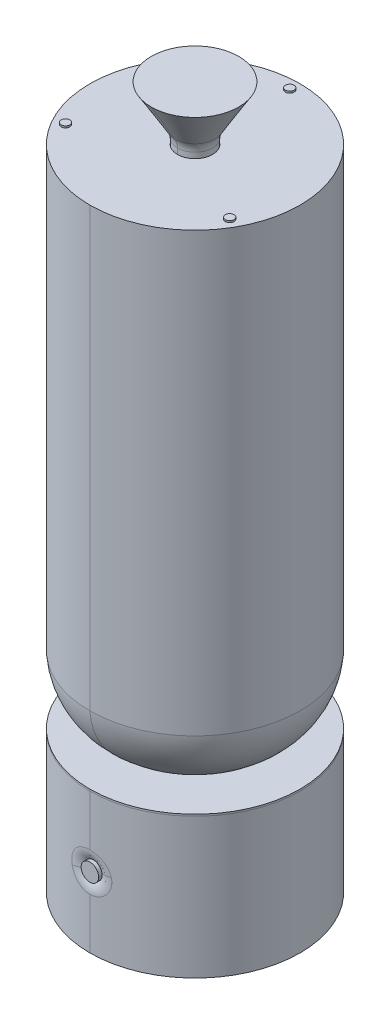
ISO-10303-21;
HEADER;
FILE_DESCRIPTION(('STEP AP214'),'2;1');
FILE_NAME('part.step','',(''),(''),'','','');
FILE_SCHEMA(('AUTOMOTIVE_DESIGN { 1 0 10303 214 1 1 1 1 }'));
ENDSEC;
DATA;
#1=APPLICATION_CONTEXT('core data for automotive mechanical design processes');
#2=APPLICATION_PROTOCOL_DEFINITION('international standard','automotive_design',2000,#1);
#3=PRODUCT_CONTEXT('',#1,'mechanical');
#4=PRODUCT('Part','Part','',(#3));
#5=PRODUCT_RELATED_PRODUCT_CATEGORY('part','',(#4));
#6=PRODUCT_DEFINITION_FORMATION('','',#4);
#7=PRODUCT_DEFINITION_CONTEXT('part definition',#1,'design');
#8=PRODUCT_DEFINITION('design','',#6,#7);
#9=PRODUCT_DEFINITION_SHAPE('','',#8);
#10=(LENGTH_UNIT() NAMED_UNIT(*) SI_UNIT(.MILLI.,.METRE.));
#11=(NAMED_UNIT(*) PLANE_ANGLE_UNIT() SI_UNIT($,.RADIAN.));
#12=(NAMED_UNIT(*) SI_UNIT($,.STERADIAN.) SOLID_ANGLE_UNIT());
#13=UNCERTAINTY_MEASURE_WITH_UNIT(LENGTH_MEASURE(1.E-05),#10,'distance_accuracy_value','');
#14=(GEOMETRIC_REPRESENTATION_CONTEXT(3) GLOBAL_UNCERTAINTY_ASSIGNED_CONTEXT((#13)) GLOBAL_UNIT_ASSIGNED_CONTEXT((#10,
#11,#12)) REPRESENTATION_CONTEXT('',''));
#15=CARTESIAN_POINT('',(0.,0.,0.));
#16=DIRECTION('',(0.,0.,1.));
#17=DIRECTION('',(1.,0.,0.));
#18=AXIS2_PLACEMENT_3D('',#15,#16,#17);
#19=CARTESIAN_POINT('',(0.,40.,58.));
#20=DIRECTION('',(0.,0.,1.));
#21=DIRECTION('',(1.,0.,0.));
#22=AXIS2_PLACEMENT_3D('',#19,#20,#21);
#23=PLANE('',#22);
#24=CARTESIAN_POINT('',(0.,40.,58.));
#25=DIRECTION('',(0.,0.,1.));
#26=DIRECTION('',(1.,0.,0.));
#27=AXIS2_PLACEMENT_3D('',#24,#25,#26);
#28=CIRCLE('',#27,5.);
#29=CARTESIAN_POINT('',(-5.,40.,58.));
#30=VERTEX_POINT('',#29);
#31=CARTESIAN_POINT('',(5.,40.,58.));
#32=VERTEX_POINT('',#31);
#33=EDGE_CURVE('P0_E10',#30,#32,#28,.T.);
#34=ORIENTED_EDGE('',*,*,#33,.F.);
#35=CARTESIAN_POINT('',(0.,40.,58.));
#36=DIRECTION('',(0.,0.,1.));
#37=DIRECTION('',(1.,0.,0.));
#38=AXIS2_PLACEMENT_3D('',#35,#36,#37);
#39=CIRCLE('',#38,5.);
#40=EDGE_CURVE('P0_E67',#32,#30,#39,.T.);
#41=ORIENTED_EDGE('',*,*,#40,.F.);
#42=EDGE_LOOP('',(#34,#41));
#43=FACE_BOUND('',#42,.T.);
#44=ADVANCED_FACE('P0_F16',(#43),#23,.F.);
#45=CARTESIAN_POINT('',(0.,40.,60.));
#46=DIRECTION('',(0.,0.,1.));
#47=DIRECTION('',(1.,0.,0.));
#48=AXIS2_PLACEMENT_3D('',#45,#46,#47);
#49=PLANE('',#48);
#50=CARTESIAN_POINT('',(0.,40.,60.));
#51=DIRECTION('',(0.,0.,1.));
#52=DIRECTION('',(1.,0.,0.));
#53=AXIS2_PLACEMENT_3D('',#50,#51,#52);
#54=CIRCLE('',#53,5.);
#55=CARTESIAN_POINT('',(-5.,40.,60.));
#56=VERTEX_POINT('',#55);
#57=CARTESIAN_POINT('',(5.,40.,60.));
#58=VERTEX_POINT('',#57);
#59=EDGE_CURVE('P0_E25',#56,#58,#54,.T.);
#60=ORIENTED_EDGE('',*,*,#59,.T.);
#61=CARTESIAN_POINT('',(0.,40.,60.));
#62=DIRECTION('',(0.,0.,1.));
#63=DIRECTION('',(1.,0.,0.));
#64=AXIS2_PLACEMENT_3D('',#61,#62,#63);
#65=CIRCLE('',#64,5.);
#66=EDGE_CURVE('P0_E57',#58,#56,#65,.T.);
#67=ORIENTED_EDGE('',*,*,#66,.T.);
#68=EDGE_LOOP('',(#60,#67));
#69=FACE_BOUND('',#68,.T.);
#70=ADVANCED_FACE('P0_F55',(#69),#49,.T.);
#71=CARTESIAN_POINT('',(0.,40.,60.));
#72=DIRECTION('',(0.,0.,-1.));
#73=DIRECTION('',(-1.,0.,0.));
#74=AXIS2_PLACEMENT_3D('',#71,#72,#73);
#75=CYLINDRICAL_SURFACE('',#74,5.);
#76=DIRECTION('',(0.,0.,-1.));
#77=VECTOR('',#76,1.);
#78=CARTESIAN_POINT('',(5.,40.,60.));
#79=LINE('',#78,#77);
#80=EDGE_CURVE('P0_E62',#58,#32,#79,.T.);
#81=ORIENTED_EDGE('',*,*,#80,.F.);
#82=ORIENTED_EDGE('',*,*,#59,.F.);
#83=DIRECTION('',(0.,0.,-1.));
#84=VECTOR('',#83,1.);
#85=CARTESIAN_POINT('',(-5.,40.,60.));
#86=LINE('',#85,#84);
#87=EDGE_CURVE('P0_E19',#56,#30,#86,.T.);
#88=ORIENTED_EDGE('',*,*,#87,.T.);
#89=ORIENTED_EDGE('',*,*,#33,.T.);
#90=EDGE_LOOP('',(#81,#82,#88,#89));
#91=FACE_BOUND('',#90,.T.);
#92=ADVANCED_FACE('P0_F63',(#91),#75,.T.);
#93=CARTESIAN_POINT('',(0.,40.,60.));
#94=DIRECTION('',(0.,0.,-1.));
#95=DIRECTION('',(-1.,0.,0.));
#96=AXIS2_PLACEMENT_3D('',#93,#94,#95);
#97=CYLINDRICAL_SURFACE('',#96,5.);
#98=ORIENTED_EDGE('',*,*,#66,.F.);
#99=ORIENTED_EDGE('',*,*,#80,.T.);
#100=ORIENTED_EDGE('',*,*,#40,.T.);
#101=ORIENTED_EDGE('',*,*,#87,.F.);
#102=EDGE_LOOP('',(#98,#99,#100,#101));
#103=FACE_BOUND('',#102,.T.);
#104=ADVANCED_FACE('P0_F69',(#103),#97,.T.);
#105=CLOSED_SHELL('',(#44,#70,#92,#104));
#106=MANIFOLD_SOLID_BREP('P0_B1',#105);
#107=CARTESIAN_POINT('',(-46.8474832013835,370.698038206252,27.0474070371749));
#108=DIRECTION('',(0.,1.,0.));
#109=DIRECTION('',(1.,0.,0.));
#110=AXIS2_PLACEMENT_3D('',#107,#108,#109);
#111=PLANE('',#110);
#112=CARTESIAN_POINT('',(-46.8474832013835,370.698038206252,27.0474070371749));
#113=DIRECTION('',(0.,1.,0.));
#114=DIRECTION('',(0.,0.,1.));
#115=AXIS2_PLACEMENT_3D('',#112,#113,#114);
#116=CIRCLE('',#115,2.46944719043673);
#117=CARTESIAN_POINT('',(-46.8474832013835,370.698038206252,24.5779598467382));
#118=VERTEX_POINT('',#117);
#119=CARTESIAN_POINT('',(-46.8474832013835,370.698038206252,29.5168542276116));
#120=VERTEX_POINT('',#119);
#121=EDGE_CURVE('P1_E11',#118,#120,#116,.T.);
#122=ORIENTED_EDGE('',*,*,#121,.T.);
#123=CARTESIAN_POINT('',(-46.8474832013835,370.698038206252,27.0474070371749));
#124=DIRECTION('',(0.,1.,0.));
#125=DIRECTION('',(0.,0.,1.));
#126=AXIS2_PLACEMENT_3D('',#123,#124,#125);
#127=CIRCLE('',#126,2.46944719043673);
#128=EDGE_CURVE('P1_E216',#120,#118,#127,.T.);
#129=ORIENTED_EDGE('',*,*,#128,.T.);
#130=EDGE_LOOP('',(#122,#129));
#131=FACE_BOUND('',#130,.T.);
#132=ADVANCED_FACE('P1_F17',(#131),#111,.T.);
#133=CARTESIAN_POINT('',(-46.8474832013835,370.698038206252,27.0474070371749));
#134=DIRECTION('',(0.,-1.,0.));
#135=DIRECTION('',(0.,0.,-1.));
#136=AXIS2_PLACEMENT_3D('',#133,#134,#135);
#137=CYLINDRICAL_SURFACE('',#136,2.46944719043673);
#138=DIRECTION('',(0.,-1.,0.));
#139=VECTOR('',#138,1.);
#140=CARTESIAN_POINT('',(-46.8474832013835,370.698038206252,29.5168542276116));
#141=LINE('',#140,#139);
#142=CARTESIAN_POINT('',(-46.8474832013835,369.698038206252,29.5168542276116));
#143=VERTEX_POINT('',#142);
#144=EDGE_CURVE('P1_E220',#120,#143,#141,.T.);
#145=ORIENTED_EDGE('',*,*,#144,.F.);
#146=ORIENTED_EDGE('',*,*,#121,.F.);
#147=DIRECTION('',(0.,-1.,0.));
#148=VECTOR('',#147,1.);
#149=CARTESIAN_POINT('',(-46.8474832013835,370.698038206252,24.5779598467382));
#150=LINE('',#149,#148);
#151=CARTESIAN_POINT('',(-46.8474832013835,369.698038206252,24.5779598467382));
#152=VERTEX_POINT('',#151);
#153=EDGE_CURVE('P1_E330',#118,#152,#150,.T.);
#154=ORIENTED_EDGE('',*,*,#153,.T.);
#155=CARTESIAN_POINT('',(-46.8474832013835,369.698038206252,27.0474070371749));
#156=DIRECTION('',(0.,1.,0.));
#157=DIRECTION('',(0.,0.,1.));
#158=AXIS2_PLACEMENT_3D('',#155,#156,#157);
#159=CIRCLE('',#158,2.46944719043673);
#160=EDGE_CURVE('P1_E252',#152,#143,#159,.T.);
#161=ORIENTED_EDGE('',*,*,#160,.T.);
#162=EDGE_LOOP('',(#145,#146,#154,#161));
#163=FACE_BOUND('',#162,.T.);
#164=ADVANCED_FACE('P1_F589',(#163),#137,.T.);
#165=CARTESIAN_POINT('',(46.8474832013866,370.698038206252,27.0474070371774));
#166=DIRECTION('',(0.,1.,0.));
#167=DIRECTION('',(1.,0.,0.));
#168=AXIS2_PLACEMENT_3D('',#165,#166,#167);
#169=PLANE('',#168);
#170=CARTESIAN_POINT('',(46.8474832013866,370.698038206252,27.0474070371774));
#171=DIRECTION('',(0.,1.,0.));
#172=DIRECTION('',(0.,0.,1.));
#173=AXIS2_PLACEMENT_3D('',#170,#171,#172);
#174=CIRCLE('',#173,2.46944719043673);
#175=CARTESIAN_POINT('',(46.8474832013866,370.698038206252,24.5779598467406));
#176=VERTEX_POINT('',#175);
#177=CARTESIAN_POINT('',(46.8474832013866,370.698038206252,29.5168542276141));
#178=VERTEX_POINT('',#177);
#179=EDGE_CURVE('P1_E28',#176,#178,#174,.T.);
#180=ORIENTED_EDGE('',*,*,#179,.T.);
#181=CARTESIAN_POINT('',(46.8474832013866,370.698038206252,27.0474070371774));
#182=DIRECTION('',(0.,1.,0.));
#183=DIRECTION('',(0.,0.,1.));
#184=AXIS2_PLACEMENT_3D('',#181,#182,#183);
#185=CIRCLE('',#184,2.46944719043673);
#186=EDGE_CURVE('P1_E311',#178,#176,#185,.T.);
#187=ORIENTED_EDGE('',*,*,#186,.T.);
#188=EDGE_LOOP('',(#180,#187));
#189=FACE_BOUND('',#188,.T.);
#190=ADVANCED_FACE('P1_F382',(#189),#169,.T.);
#191=CARTESIAN_POINT('',(46.8474832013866,370.698038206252,27.0474070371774));
#192=DIRECTION('',(0.,-1.,0.));
#193=DIRECTION('',(0.,0.,-1.));
#194=AXIS2_PLACEMENT_3D('',#191,#192,#193);
#195=CYLINDRICAL_SURFACE('',#194,2.46944719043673);
#196=DIRECTION('',(0.,-1.,0.));
#197=VECTOR('',#196,1.);
#198=CARTESIAN_POINT('',(46.8474832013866,370.698038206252,29.5168542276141));
#199=LINE('',#198,#197);
#200=CARTESIAN_POINT('',(46.8474832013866,369.698038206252,29.5168542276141));
#201=VERTEX_POINT('',#200);
#202=EDGE_CURVE('P1_E342',#178,#201,#199,.T.);
#203=ORIENTED_EDGE('',*,*,#202,.F.);
#204=ORIENTED_EDGE('',*,*,#179,.F.);
#205=DIRECTION('',(0.,-1.,0.));
#206=VECTOR('',#205,1.);
#207=CARTESIAN_POINT('',(46.8474832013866,370.698038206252,24.5779598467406));
#208=LINE('',#207,#206);
#209=CARTESIAN_POINT('',(46.8474832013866,369.698038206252,24.5779598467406));
#210=VERTEX_POINT('',#209);
#211=EDGE_CURVE('P1_E247',#176,#210,#208,.T.);
#212=ORIENTED_EDGE('',*,*,#211,.T.);
#213=CARTESIAN_POINT('',(46.8474832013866,369.698038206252,27.0474070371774));
#214=DIRECTION('',(0.,1.,0.));
#215=DIRECTION('',(0.,0.,1.));
#216=AXIS2_PLACEMENT_3D('',#213,#214,#215);
#217=CIRCLE('',#216,2.46944719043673);
#218=EDGE_CURVE('P1_E254',#210,#201,#217,.T.);
#219=ORIENTED_EDGE('',*,*,#218,.T.);
#220=EDGE_LOOP('',(#203,#204,#212,#219));
#221=FACE_BOUND('',#220,.T.);
#222=ADVANCED_FACE('P1_F380',(#221),#195,.T.);
#223=CARTESIAN_POINT('',(3.74126871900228E-12,370.698038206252,-54.0948140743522));
#224=DIRECTION('',(0.,1.,0.));
#225=DIRECTION('',(1.,0.,0.));
#226=AXIS2_PLACEMENT_3D('',#223,#224,#225);
#227=PLANE('',#226);
#228=CARTESIAN_POINT('',(3.74126871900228E-12,370.698038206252,-54.0948140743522));
#229=DIRECTION('',(0.,1.,0.));
#230=DIRECTION('',(0.,0.,1.));
#231=AXIS2_PLACEMENT_3D('',#228,#229,#230);
#232=CIRCLE('',#231,2.46944719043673);
#233=CARTESIAN_POINT('',(3.74126871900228E-12,370.698038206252,-56.564261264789));
#234=VERTEX_POINT('',#233);
#235=CARTESIAN_POINT('',(3.74157113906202E-12,370.698038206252,-51.6253668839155));
#236=VERTEX_POINT('',#235);
#237=EDGE_CURVE('P1_E238',#234,#236,#232,.T.);
#238=ORIENTED_EDGE('',*,*,#237,.T.);
#239=CARTESIAN_POINT('',(3.74126871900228E-12,370.698038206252,-54.0948140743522));
#240=DIRECTION('',(0.,1.,0.));
#241=DIRECTION('',(0.,0.,1.));
#242=AXIS2_PLACEMENT_3D('',#239,#240,#241);
#243=CIRCLE('',#242,2.46944719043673);
#244=EDGE_CURVE('P1_E250',#236,#234,#243,.T.);
#245=ORIENTED_EDGE('',*,*,#244,.T.);
#246=EDGE_LOOP('',(#238,#245));
#247=FACE_BOUND('',#246,.T.);
#248=ADVANCED_FACE('P1_F19',(#247),#227,.T.);
#249=CARTESIAN_POINT('',(3.74126871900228E-12,370.698038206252,-54.0948140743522));
#250=DIRECTION('',(0.,-1.,0.));
#251=DIRECTION('',(0.,0.,-1.));
#252=AXIS2_PLACEMENT_3D('',#249,#250,#251);
#253=CYLINDRICAL_SURFACE('',#252,2.46944719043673);
#254=DIRECTION('',(0.,-1.,0.));
#255=VECTOR('',#254,1.);
#256=CARTESIAN_POINT('',(3.74157113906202E-12,370.698038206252,-51.6253668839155));
#257=LINE('',#256,#255);
#258=CARTESIAN_POINT('',(3.74157113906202E-12,369.698038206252,-51.6253668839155));
#259=VERTEX_POINT('',#258);
#260=EDGE_CURVE('P1_E326',#236,#259,#257,.T.);
#261=ORIENTED_EDGE('',*,*,#260,.F.);
#262=ORIENTED_EDGE('',*,*,#237,.F.);
#263=DIRECTION('',(0.,-1.,0.));
#264=VECTOR('',#263,1.);
#265=CARTESIAN_POINT('',(3.74126871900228E-12,370.698038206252,-56.564261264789));
#266=LINE('',#265,#264);
#267=CARTESIAN_POINT('',(3.74126871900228E-12,369.698038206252,-56.564261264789));
#268=VERTEX_POINT('',#267);
#269=EDGE_CURVE('P1_E341',#234,#268,#266,.T.);
#270=ORIENTED_EDGE('',*,*,#269,.T.);
#271=CARTESIAN_POINT('',(3.74126871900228E-12,369.698038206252,-54.0948140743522));
#272=DIRECTION('',(0.,1.,0.));
#273=DIRECTION('',(0.,0.,1.));
#274=AXIS2_PLACEMENT_3D('',#271,#272,#273);
#275=CIRCLE('',#274,2.46944719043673);
#276=EDGE_CURVE('P1_E241',#268,#259,#275,.T.);
#277=ORIENTED_EDGE('',*,*,#276,.T.);
#278=EDGE_LOOP('',(#261,#262,#270,#277));
#279=FACE_BOUND('',#278,.T.);
#280=ADVANCED_FACE('P1_F545',(#279),#253,.T.);
#281=CARTESIAN_POINT('',(0.,369.698038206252,0.));
#282=DIRECTION('',(0.,1.,0.));
#283=DIRECTION('',(1.,0.,0.));
#284=AXIS2_PLACEMENT_3D('',#281,#282,#283);
#285=PLANE('',#284);
#286=CARTESIAN_POINT('',(0.,369.698038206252,0.));
#287=DIRECTION('',(0.,1.,0.));
#288=DIRECTION('',(0.,0.,1.));
#289=AXIS2_PLACEMENT_3D('',#286,#287,#288);
#290=CIRCLE('',#289,10.0110550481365);
#291=CARTESIAN_POINT('',(0.,369.698038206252,10.0110550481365));
#292=VERTEX_POINT('',#291);
#293=CARTESIAN_POINT('',(0.,369.698038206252,-10.0110550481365));
#294=VERTEX_POINT('',#293);
#295=EDGE_CURVE('P1_E193',#292,#294,#290,.T.);
#296=ORIENTED_EDGE('',*,*,#295,.F.);
#297=CARTESIAN_POINT('',(0.,369.698038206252,0.));
#298=DIRECTION('',(0.,1.,0.));
#299=DIRECTION('',(0.,0.,1.));
#300=AXIS2_PLACEMENT_3D('',#297,#298,#299);
#301=CIRCLE('',#300,10.0110550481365);
#302=EDGE_CURVE('P1_E213',#294,#292,#301,.T.);
#303=ORIENTED_EDGE('',*,*,#302,.F.);
#304=EDGE_LOOP('',(#296,#303));
#305=FACE_BOUND('',#304,.T.);
#306=ORIENTED_EDGE('',*,*,#276,.F.);
#307=CARTESIAN_POINT('',(3.74126871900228E-12,369.698038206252,-54.0948140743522));
#308=DIRECTION('',(0.,1.,0.));
#309=DIRECTION('',(0.,0.,1.));
#310=AXIS2_PLACEMENT_3D('',#307,#308,#309);
#311=CIRCLE('',#310,2.46944719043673);
#312=EDGE_CURVE('P1_E337',#259,#268,#311,.T.);
#313=ORIENTED_EDGE('',*,*,#312,.F.);
#314=EDGE_LOOP('',(#306,#313));
#315=FACE_BOUND('',#314,.T.);
#316=ORIENTED_EDGE('',*,*,#218,.F.);
#317=CARTESIAN_POINT('',(46.8474832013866,369.698038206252,27.0474070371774));
#318=DIRECTION('',(0.,1.,0.));
#319=DIRECTION('',(0.,0.,1.));
#320=AXIS2_PLACEMENT_3D('',#317,#318,#319);
#321=CIRCLE('',#320,2.46944719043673);
#322=EDGE_CURVE('P1_E251',#201,#210,#321,.T.);
#323=ORIENTED_EDGE('',*,*,#322,.F.);
#324=EDGE_LOOP('',(#316,#323));
#325=FACE_BOUND('',#324,.T.);
#326=ORIENTED_EDGE('',*,*,#160,.F.);
#327=CARTESIAN_POINT('',(-46.8474832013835,369.698038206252,27.0474070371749));
#328=DIRECTION('',(0.,1.,0.));
#329=DIRECTION('',(0.,0.,1.));
#330=AXIS2_PLACEMENT_3D('',#327,#328,#329);
#331=CIRCLE('',#330,2.46944719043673);
#332=EDGE_CURVE('P1_E316',#143,#152,#331,.T.);
#333=ORIENTED_EDGE('',*,*,#332,.F.);
#334=EDGE_LOOP('',(#326,#333));
#335=FACE_BOUND('',#334,.T.);
#336=CARTESIAN_POINT('',(0.,369.698038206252,0.));
#337=DIRECTION('',(0.,-1.,0.));
#338=DIRECTION('',(0.,0.,-1.));
#339=AXIS2_PLACEMENT_3D('',#336,#337,#338);
#340=CIRCLE('',#339,60.);
#341=CARTESIAN_POINT('',(0.,369.698038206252,-60.));
#342=VERTEX_POINT('',#341);
#343=CARTESIAN_POINT('',(0.,369.698038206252,60.));
#344=VERTEX_POINT('',#343);
#345=EDGE_CURVE('P1_E42',#342,#344,#340,.T.);
#346=ORIENTED_EDGE('',*,*,#345,.F.);
#347=CARTESIAN_POINT('',(0.,369.698038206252,0.));
#348=DIRECTION('',(0.,-1.,0.));
#349=DIRECTION('',(0.,0.,-1.));
#350=AXIS2_PLACEMENT_3D('',#347,#348,#349);
#351=CIRCLE('',#350,60.);
#352=EDGE_CURVE('P1_E270',#344,#342,#351,.T.);
#353=ORIENTED_EDGE('',*,*,#352,.F.);
#354=EDGE_LOOP('',(#346,#353));
#355=FACE_BOUND('',#354,.T.);
#356=ADVANCED_FACE('P1_F377',(#305,#315,#325,#335,#355),#285,.T.);
#357=CARTESIAN_POINT('',(0.,119.698038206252,0.));
#358=DIRECTION('',(0.,-1.,0.));
#359=DIRECTION('',(0.,0.,-1.));
#360=AXIS2_PLACEMENT_3D('',#357,#358,#359);
#361=CYLINDRICAL_SURFACE('',#360,60.);
#362=ORIENTED_EDGE('',*,*,#345,.T.);
#363=DIRECTION('',(0.,-1.,0.));
#364=VECTOR('',#363,1.);
#365=CARTESIAN_POINT('',(0.,119.698038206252,60.));
#366=LINE('',#365,#364);
#367=CARTESIAN_POINT('',(0.,119.698038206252,60.));
#368=VERTEX_POINT('',#367);
#369=EDGE_CURVE('P1_E364',#344,#368,#366,.T.);
#370=ORIENTED_EDGE('',*,*,#369,.T.);
#371=CARTESIAN_POINT('',(0.,119.698038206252,0.));
#372=DIRECTION('',(0.,-1.,0.));
#373=DIRECTION('',(0.,0.,-1.));
#374=AXIS2_PLACEMENT_3D('',#371,#372,#373);
#375=CIRCLE('',#374,60.);
#376=CARTESIAN_POINT('',(0.,119.698038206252,-60.));
#377=VERTEX_POINT('',#376);
#378=EDGE_CURVE('P1_E178',#377,#368,#375,.T.);
#379=ORIENTED_EDGE('',*,*,#378,.F.);
#380=DIRECTION('',(0.,-1.,0.));
#381=VECTOR('',#380,1.);
#382=CARTESIAN_POINT('',(0.,119.698038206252,-60.));
#383=LINE('',#382,#381);
#384=EDGE_CURVE('P1_E264',#342,#377,#383,.T.);
#385=ORIENTED_EDGE('',*,*,#384,.F.);
#386=EDGE_LOOP('',(#362,#370,#379,#385));
#387=FACE_BOUND('',#386,.T.);
#388=ADVANCED_FACE('P1_F429',(#387),#361,.T.);
#389=CARTESIAN_POINT('',(0.,119.698038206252,0.));
#390=DIRECTION('',(0.,-1.,0.));
#391=DIRECTION('',(0.,0.,-1.));
#392=AXIS2_PLACEMENT_3D('',#389,#390,#391);
#393=CYLINDRICAL_SURFACE('',#392,60.);
#394=ORIENTED_EDGE('',*,*,#369,.F.);
#395=ORIENTED_EDGE('',*,*,#352,.T.);
#396=ORIENTED_EDGE('',*,*,#384,.T.);
#397=CARTESIAN_POINT('',(0.,119.698038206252,0.));
#398=DIRECTION('',(0.,-1.,0.));
#399=DIRECTION('',(0.,0.,-1.));
#400=AXIS2_PLACEMENT_3D('',#397,#398,#399);
#401=CIRCLE('',#400,60.);
#402=EDGE_CURVE('P1_E21',#368,#377,#401,.T.);
#403=ORIENTED_EDGE('',*,*,#402,.F.);
#404=EDGE_LOOP('',(#394,#395,#396,#403));
#405=FACE_BOUND('',#404,.T.);
#406=ADVANCED_FACE('P1_F430',(#405),#393,.T.);
#407=CARTESIAN_POINT('',(0.,122.750831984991,0.));
#408=DIRECTION('',(0.,-1.,0.));
#409=DIRECTION('',(0.,0.,-1.));
#410=AXIS2_PLACEMENT_3D('',#407,#408,#409);
#411=DEGENERATE_TOROIDAL_SURFACE('',#410,17.3583057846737,42.7508319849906,.T.);
#412=ORIENTED_EDGE('',*,*,#378,.T.);
#413=CARTESIAN_POINT('',(0.,122.750831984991,17.3583057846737));
#414=DIRECTION('',(1.,0.,0.));
#415=DIRECTION('',(0.,0.,-1.));
#416=AXIS2_PLACEMENT_3D('',#413,#414,#415);
#417=CIRCLE('',#416,42.7508319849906);
#418=CARTESIAN_POINT('',(0.,80.,17.3583057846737));
#419=VERTEX_POINT('',#418);
#420=EDGE_CURVE('P1_E171',#368,#419,#417,.T.);
#421=ORIENTED_EDGE('',*,*,#420,.T.);
#422=CARTESIAN_POINT('',(0.,80.,0.));
#423=DIRECTION('',(0.,-1.,0.));
#424=DIRECTION('',(0.,0.,-1.));
#425=AXIS2_PLACEMENT_3D('',#422,#423,#424);
#426=CIRCLE('',#425,17.3583057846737);
#427=CARTESIAN_POINT('',(0.,80.,-17.3583057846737));
#428=VERTEX_POINT('',#427);
#429=EDGE_CURVE('P1_E176',#428,#419,#426,.T.);
#430=ORIENTED_EDGE('',*,*,#429,.F.);
#431=CARTESIAN_POINT('',(0.,122.750831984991,-17.3583057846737));
#432=DIRECTION('',(-1.,0.,0.));
#433=DIRECTION('',(0.,0.,1.));
#434=AXIS2_PLACEMENT_3D('',#431,#432,#433);
#435=CIRCLE('',#434,42.7508319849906);
#436=EDGE_CURVE('P1_E187',#377,#428,#435,.T.);
#437=ORIENTED_EDGE('',*,*,#436,.F.);
#438=EDGE_LOOP('',(#412,#421,#430,#437));
#439=FACE_BOUND('',#438,.T.);
#440=ADVANCED_FACE('P1_F173',(#439),#411,.T.);
#441=CARTESIAN_POINT('',(0.,122.750831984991,0.));
#442=DIRECTION('',(0.,-1.,0.));
#443=DIRECTION('',(0.,0.,-1.));
#444=AXIS2_PLACEMENT_3D('',#441,#442,#443);
#445=DEGENERATE_TOROIDAL_SURFACE('',#444,17.3583057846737,42.7508319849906,.T.);
#446=ORIENTED_EDGE('',*,*,#420,.F.);
#447=ORIENTED_EDGE('',*,*,#402,.T.);
#448=ORIENTED_EDGE('',*,*,#436,.T.);
#449=CARTESIAN_POINT('',(0.,80.,0.));
#450=DIRECTION('',(0.,-1.,0.));
#451=DIRECTION('',(0.,0.,-1.));
#452=AXIS2_PLACEMENT_3D('',#449,#450,#451);
#453=CIRCLE('',#452,17.3583057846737);
#454=EDGE_CURVE('P1_E183',#419,#428,#453,.T.);
#455=ORIENTED_EDGE('',*,*,#454,.F.);
#456=EDGE_LOOP('',(#446,#447,#448,#455));
#457=FACE_BOUND('',#456,.T.);
#458=ADVANCED_FACE('P1_F186',(#457),#445,.T.);
#459=CARTESIAN_POINT('',(-17.3583057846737,80.,0.));
#460=DIRECTION('',(0.,1.,0.));
#461=DIRECTION('',(1.,0.,0.));
#462=AXIS2_PLACEMENT_3D('',#459,#460,#461);
#463=PLANE('',#462);
#464=ORIENTED_EDGE('',*,*,#429,.T.);
#465=ORIENTED_EDGE('',*,*,#454,.T.);
#466=EDGE_LOOP('',(#464,#465));
#467=FACE_BOUND('',#466,.T.);
#468=ADVANCED_FACE('P1_F191',(#467),#463,.F.);
#469=CARTESIAN_POINT('',(0.,368.698038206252,0.));
#470=DIRECTION('',(0.,1.,0.));
#471=DIRECTION('',(0.,0.,1.));
#472=AXIS2_PLACEMENT_3D('',#469,#470,#471);
#473=CYLINDRICAL_SURFACE('',#472,10.0110550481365);
#474=DIRECTION('',(0.,1.,0.));
#475=VECTOR('',#474,1.);
#476=CARTESIAN_POINT('',(0.,368.698038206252,-10.0110550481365));
#477=LINE('',#476,#475);
#478=CARTESIAN_POINT('',(0.,368.698038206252,-10.0110550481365));
#479=VERTEX_POINT('',#478);
#480=EDGE_CURVE('P1_E210',#479,#294,#477,.T.);
#481=ORIENTED_EDGE('',*,*,#480,.F.);
#482=CARTESIAN_POINT('',(0.,368.698038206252,0.));
#483=DIRECTION('',(0.,1.,0.));
#484=DIRECTION('',(0.,0.,1.));
#485=AXIS2_PLACEMENT_3D('',#482,#483,#484);
#486=CIRCLE('',#485,10.0110550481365);
#487=CARTESIAN_POINT('',(0.,368.698038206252,10.0110550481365));
#488=VERTEX_POINT('',#487);
#489=EDGE_CURVE('P1_E199',#488,#479,#486,.T.);
#490=ORIENTED_EDGE('',*,*,#489,.F.);
#491=DIRECTION('',(0.,1.,0.));
#492=VECTOR('',#491,1.);
#493=CARTESIAN_POINT('',(0.,368.698038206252,10.0110550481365));
#494=LINE('',#493,#492);
#495=EDGE_CURVE('P1_E242',#488,#292,#494,.T.);
#496=ORIENTED_EDGE('',*,*,#495,.T.);
#497=ORIENTED_EDGE('',*,*,#295,.T.);
#498=EDGE_LOOP('',(#481,#490,#496,#497));
#499=FACE_BOUND('',#498,.T.);
#500=ADVANCED_FACE('P1_F673',(#499),#473,.F.);
#501=CARTESIAN_POINT('',(0.,368.698038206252,0.));
#502=DIRECTION('',(0.,1.,0.));
#503=DIRECTION('',(1.,0.,0.));
#504=AXIS2_PLACEMENT_3D('',#501,#502,#503);
#505=PLANE('',#504);
#506=ORIENTED_EDGE('',*,*,#489,.T.);
#507=CARTESIAN_POINT('',(0.,368.698038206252,0.));
#508=DIRECTION('',(0.,1.,0.));
#509=DIRECTION('',(0.,0.,1.));
#510=AXIS2_PLACEMENT_3D('',#507,#508,#509);
#511=CIRCLE('',#510,10.0110550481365);
#512=EDGE_CURVE('P1_E214',#479,#488,#511,.T.);
#513=ORIENTED_EDGE('',*,*,#512,.T.);
#514=EDGE_LOOP('',(#506,#513));
#515=FACE_BOUND('',#514,.T.);
#516=CARTESIAN_POINT('',(0.,368.698038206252,0.));
#517=DIRECTION('',(0.,1.,0.));
#518=DIRECTION('',(0.,0.,1.));
#519=AXIS2_PLACEMENT_3D('',#516,#517,#518);
#520=CIRCLE('',#519,58.5132648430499);
#521=CARTESIAN_POINT('',(0.,368.698038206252,58.5132648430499));
#522=VERTEX_POINT('',#521);
#523=CARTESIAN_POINT('',(0.,368.698038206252,-58.5132648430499));
#524=VERTEX_POINT('',#523);
#525=EDGE_CURVE('P1_E335',#522,#524,#520,.T.);
#526=ORIENTED_EDGE('',*,*,#525,.F.);
#527=CARTESIAN_POINT('',(0.,368.698038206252,0.));
#528=DIRECTION('',(0.,1.,0.));
#529=DIRECTION('',(0.,0.,1.));
#530=AXIS2_PLACEMENT_3D('',#527,#528,#529);
#531=CIRCLE('',#530,58.5132648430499);
#532=EDGE_CURVE('P1_E246',#524,#522,#531,.T.);
#533=ORIENTED_EDGE('',*,*,#532,.F.);
#534=EDGE_LOOP('',(#526,#533));
#535=FACE_BOUND('',#534,.T.);
#536=ADVANCED_FACE('P1_F677',(#515,#535),#505,.F.);
#537=CARTESIAN_POINT('',(0.,372.913505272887,0.));
#538=DIRECTION('',(0.,-1.,0.));
#539=DIRECTION('',(0.,0.,-1.));
#540=AXIS2_PLACEMENT_3D('',#537,#538,#539);
#541=TOROIDAL_SURFACE('',#540,20.,10.);
#542=CARTESIAN_POINT('',(0.,372.913505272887,20.));
#543=DIRECTION('',(1.,0.,0.));
#544=DIRECTION('',(0.,0.,-1.));
#545=AXIS2_PLACEMENT_3D('',#542,#543,#544);
#546=CIRCLE('',#545,10.);
#547=CARTESIAN_POINT('',(0.,372.913505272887,10.));
#548=VERTEX_POINT('',#547);
#549=CARTESIAN_POINT('',(0.,378.056007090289,11.4235977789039));
#550=VERTEX_POINT('',#549);
#551=EDGE_CURVE('P1_E231',#548,#550,#546,.T.);
#552=ORIENTED_EDGE('',*,*,#551,.F.);
#553=CARTESIAN_POINT('',(0.,372.913505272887,0.));
#554=DIRECTION('',(0.,-1.,0.));
#555=DIRECTION('',(0.,0.,-1.));
#556=AXIS2_PLACEMENT_3D('',#553,#554,#555);
#557=CIRCLE('',#556,10.);
#558=CARTESIAN_POINT('',(0.,372.913505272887,-10.));
#559=VERTEX_POINT('',#558);
#560=EDGE_CURVE('P1_E281',#559,#548,#557,.T.);
#561=ORIENTED_EDGE('',*,*,#560,.F.);
#562=CARTESIAN_POINT('',(0.,372.913505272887,-20.));
#563=DIRECTION('',(-1.,0.,0.));
#564=DIRECTION('',(0.,0.,1.));
#565=AXIS2_PLACEMENT_3D('',#562,#563,#564);
#566=CIRCLE('',#565,10.);
#567=CARTESIAN_POINT('',(0.,378.056007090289,-11.4235977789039));
#568=VERTEX_POINT('',#567);
#569=EDGE_CURVE('P1_E286',#559,#568,#566,.T.);
#570=ORIENTED_EDGE('',*,*,#569,.T.);
#571=CARTESIAN_POINT('',(0.,378.056007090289,0.));
#572=DIRECTION('',(0.,-1.,0.));
#573=DIRECTION('',(0.,0.,-1.));
#574=AXIS2_PLACEMENT_3D('',#571,#572,#573);
#575=CIRCLE('',#574,11.4235977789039);
#576=EDGE_CURVE('P1_E209',#568,#550,#575,.T.);
#577=ORIENTED_EDGE('',*,*,#576,.T.);
#578=EDGE_LOOP('',(#552,#561,#570,#577));
#579=FACE_BOUND('',#578,.T.);
#580=ADVANCED_FACE('P1_F766',(#579),#541,.F.);
#581=CARTESIAN_POINT('',(0.,400.698038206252,0.));
#582=DIRECTION('',(0.,1.,0.));
#583=DIRECTION('',(0.,0.,1.));
#584=AXIS2_PLACEMENT_3D('',#581,#582,#583);
#585=CONICAL_SURFACE('',#584,25.,0.54013313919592);
#586=DIRECTION('',(0.,0.857640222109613,-0.514250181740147));
#587=VECTOR('',#586,1.);
#588=CARTESIAN_POINT('',(0.,400.698038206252,-25.));
#589=LINE('',#588,#587);
#590=CARTESIAN_POINT('',(0.,400.698038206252,-25.));
#591=VERTEX_POINT('',#590);
#592=EDGE_CURVE('P1_E204',#568,#591,#589,.T.);
#593=ORIENTED_EDGE('',*,*,#592,.F.);
#594=CARTESIAN_POINT('',(0.,378.056007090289,0.));
#595=DIRECTION('',(0.,-1.,0.));
#596=DIRECTION('',(0.,0.,-1.));
#597=AXIS2_PLACEMENT_3D('',#594,#595,#596);
#598=CIRCLE('',#597,11.4235977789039);
#599=EDGE_CURVE('P1_E283',#550,#568,#598,.T.);
#600=ORIENTED_EDGE('',*,*,#599,.F.);
#601=DIRECTION('',(0.,0.857640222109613,0.514250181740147));
#602=VECTOR('',#601,1.);
#603=CARTESIAN_POINT('',(0.,400.698038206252,25.));
#604=LINE('',#603,#602);
#605=CARTESIAN_POINT('',(0.,400.698038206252,25.));
#606=VERTEX_POINT('',#605);
#607=EDGE_CURVE('P1_E320',#550,#606,#604,.T.);
#608=ORIENTED_EDGE('',*,*,#607,.T.);
#609=CARTESIAN_POINT('',(0.,400.698038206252,0.));
#610=DIRECTION('',(0.,-1.,0.));
#611=DIRECTION('',(0.,0.,-1.));
#612=AXIS2_PLACEMENT_3D('',#609,#610,#611);
#613=CIRCLE('',#612,25.);
#614=EDGE_CURVE('P1_E352',#606,#591,#613,.T.);
#615=ORIENTED_EDGE('',*,*,#614,.T.);
#616=EDGE_LOOP('',(#593,#600,#608,#615));
#617=FACE_BOUND('',#616,.T.);
#618=ADVANCED_FACE('P1_F612',(#617),#585,.T.);
#619=CARTESIAN_POINT('',(0.,400.698038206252,0.));
#620=DIRECTION('',(0.,-1.,0.));
#621=DIRECTION('',(0.,0.,-1.));
#622=AXIS2_PLACEMENT_3D('',#619,#620,#621);
#623=PLANE('',#622);
#624=ORIENTED_EDGE('',*,*,#614,.F.);
#625=CARTESIAN_POINT('',(0.,400.698038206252,0.));
#626=DIRECTION('',(0.,-1.,0.));
#627=DIRECTION('',(0.,0.,-1.));
#628=AXIS2_PLACEMENT_3D('',#625,#626,#627);
#629=CIRCLE('',#628,25.);
#630=EDGE_CURVE('P1_E208',#591,#606,#629,.T.);
#631=ORIENTED_EDGE('',*,*,#630,.F.);
#632=EDGE_LOOP('',(#624,#631));
#633=FACE_BOUND('',#632,.T.);
#634=ADVANCED_FACE('P1_F608',(#633),#623,.F.);
#635=CARTESIAN_POINT('',(60.,119.698038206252,0.));
#636=DIRECTION('',(0.,-1.,0.));
#637=DIRECTION('',(0.,0.,-1.));
#638=AXIS2_PLACEMENT_3D('',#635,#636,#637);
#639=PLANE('',#638);
#640=CARTESIAN_POINT('',(0.,119.698038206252,0.));
#641=DIRECTION('',(0.,-1.,0.));
#642=DIRECTION('',(0.,0.,-1.));
#643=AXIS2_PLACEMENT_3D('',#640,#641,#642);
#644=CIRCLE('',#643,58.5132648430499);
#645=CARTESIAN_POINT('',(0.,119.698038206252,58.5132648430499));
#646=VERTEX_POINT('',#645);
#647=CARTESIAN_POINT('',(0.,119.698038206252,-58.5132648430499));
#648=VERTEX_POINT('',#647);
#649=EDGE_CURVE('P1_E336',#646,#648,#644,.T.);
#650=ORIENTED_EDGE('',*,*,#649,.F.);
#651=CARTESIAN_POINT('',(0.,119.698038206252,0.));
#652=DIRECTION('',(0.,-1.,0.));
#653=DIRECTION('',(0.,0.,-1.));
#654=AXIS2_PLACEMENT_3D('',#651,#652,#653);
#655=CIRCLE('',#654,58.5132648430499);
#656=EDGE_CURVE('P1_E232',#648,#646,#655,.T.);
#657=ORIENTED_EDGE('',*,*,#656,.F.);
#658=EDGE_LOOP('',(#650,#657));
#659=FACE_BOUND('',#658,.T.);
#660=CARTESIAN_POINT('',(0.,119.698038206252,0.));
#661=DIRECTION('',(0.,-1.,0.));
#662=DIRECTION('',(0.,0.,-1.));
#663=AXIS2_PLACEMENT_3D('',#660,#661,#662);
#664=CIRCLE('',#663,58.9973790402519);
#665=CARTESIAN_POINT('',(0.,119.698038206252,-58.9973790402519));
#666=VERTEX_POINT('',#665);
#667=CARTESIAN_POINT('',(0.,119.698038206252,58.9973790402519));
#668=VERTEX_POINT('',#667);
#669=EDGE_CURVE('P1_E355',#666,#668,#664,.T.);
#670=ORIENTED_EDGE('',*,*,#669,.T.);
#671=CARTESIAN_POINT('',(0.,119.698038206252,0.));
#672=DIRECTION('',(0.,-1.,0.));
#673=DIRECTION('',(0.,0.,-1.));
#674=AXIS2_PLACEMENT_3D('',#671,#672,#673);
#675=CIRCLE('',#674,58.9973790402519);
#676=EDGE_CURVE('P1_E287',#668,#666,#675,.T.);
#677=ORIENTED_EDGE('',*,*,#676,.T.);
#678=EDGE_LOOP('',(#670,#677));
#679=FACE_BOUND('',#678,.T.);
#680=ADVANCED_FACE('P1_F601',(#659,#679),#639,.T.);
#681=CARTESIAN_POINT('',(0.,52.7157287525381,0.));
#682=DIRECTION('',(0.,1.,0.));
#683=DIRECTION('',(0.,0.,1.));
#684=AXIS2_PLACEMENT_3D('',#681,#682,#683);
#685=CYLINDRICAL_SURFACE('',#684,10.);
#686=DIRECTION('',(0.,1.,0.));
#687=VECTOR('',#686,1.);
#688=CARTESIAN_POINT('',(0.,52.7157287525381,-10.));
#689=LINE('',#688,#687);
#690=CARTESIAN_POINT('',(0.,81.,-10.));
#691=VERTEX_POINT('',#690);
#692=EDGE_CURVE('P1_E277',#691,#559,#689,.T.);
#693=ORIENTED_EDGE('',*,*,#692,.F.);
#694=CARTESIAN_POINT('',(0.,81.,0.));
#695=DIRECTION('',(0.,1.,0.));
#696=DIRECTION('',(0.,0.,1.));
#697=AXIS2_PLACEMENT_3D('',#694,#695,#696);
#698=CIRCLE('',#697,10.);
#699=CARTESIAN_POINT('',(0.,81.,10.));
#700=VERTEX_POINT('',#699);
#701=EDGE_CURVE('P1_E225',#691,#700,#698,.T.);
#702=ORIENTED_EDGE('',*,*,#701,.T.);
#703=DIRECTION('',(0.,1.,0.));
#704=VECTOR('',#703,1.);
#705=CARTESIAN_POINT('',(0.,52.7157287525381,10.));
#706=LINE('',#705,#704);
#707=EDGE_CURVE('P1_E290',#700,#548,#706,.T.);
#708=ORIENTED_EDGE('',*,*,#707,.T.);
#709=CARTESIAN_POINT('',(0.,372.913505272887,0.));
#710=DIRECTION('',(0.,-1.,0.));
#711=DIRECTION('',(0.,0.,-1.));
#712=AXIS2_PLACEMENT_3D('',#709,#710,#711);
#713=CIRCLE('',#712,10.);
#714=EDGE_CURVE('P1_E227',#548,#559,#713,.T.);
#715=ORIENTED_EDGE('',*,*,#714,.T.);
#716=EDGE_LOOP('',(#693,#702,#708,#715));
#717=FACE_BOUND('',#716,.T.);
#718=ADVANCED_FACE('P1_F596',(#717),#685,.T.);
#719=CARTESIAN_POINT('',(0.,122.750831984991,0.));
#720=DIRECTION('',(0.,-1.,0.));
#721=DIRECTION('',(0.,0.,-1.));
#722=AXIS2_PLACEMENT_3D('',#719,#720,#721);
#723=DEGENERATE_TOROIDAL_SURFACE('',#722,17.3583057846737,41.7508319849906,.T.);
#724=CARTESIAN_POINT('',(0.,122.750831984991,17.3583057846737));
#725=DIRECTION('',(1.,0.,0.));
#726=DIRECTION('',(0.,0.,-1.));
#727=AXIS2_PLACEMENT_3D('',#724,#725,#726);
#728=CIRCLE('',#727,41.7508319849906);
#729=CARTESIAN_POINT('',(0.,81.,17.3583057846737));
#730=VERTEX_POINT('',#729);
#731=EDGE_CURVE('P1_E237',#668,#730,#728,.T.);
#732=ORIENTED_EDGE('',*,*,#731,.F.);
#733=ORIENTED_EDGE('',*,*,#669,.F.);
#734=CARTESIAN_POINT('',(0.,122.750831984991,-17.3583057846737));
#735=DIRECTION('',(-1.,0.,0.));
#736=DIRECTION('',(0.,0.,1.));
#737=AXIS2_PLACEMENT_3D('',#734,#735,#736);
#738=CIRCLE('',#737,41.7508319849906);
#739=CARTESIAN_POINT('',(0.,81.,-17.3583057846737));
#740=VERTEX_POINT('',#739);
#741=EDGE_CURVE('P1_E226',#666,#740,#738,.T.);
#742=ORIENTED_EDGE('',*,*,#741,.T.);
#743=CARTESIAN_POINT('',(0.,81.,0.));
#744=DIRECTION('',(0.,-1.,0.));
#745=DIRECTION('',(0.,0.,-1.));
#746=AXIS2_PLACEMENT_3D('',#743,#744,#745);
#747=CIRCLE('',#746,17.3583057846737);
#748=EDGE_CURVE('P1_E221',#740,#730,#747,.T.);
#749=ORIENTED_EDGE('',*,*,#748,.T.);
#750=EDGE_LOOP('',(#732,#733,#742,#749));
#751=FACE_BOUND('',#750,.T.);
#752=ADVANCED_FACE('P1_F600',(#751),#723,.F.);
#753=CARTESIAN_POINT('',(-17.3583057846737,81.,0.));
#754=DIRECTION('',(0.,1.,0.));
#755=DIRECTION('',(1.,0.,0.));
#756=AXIS2_PLACEMENT_3D('',#753,#754,#755);
#757=PLANE('',#756);
#758=CARTESIAN_POINT('',(0.,81.,0.));
#759=DIRECTION('',(0.,1.,0.));
#760=DIRECTION('',(0.,0.,1.));
#761=AXIS2_PLACEMENT_3D('',#758,#759,#760);
#762=CIRCLE('',#761,10.);
#763=EDGE_CURVE('P1_E282',#700,#691,#762,.T.);
#764=ORIENTED_EDGE('',*,*,#763,.F.);
#765=ORIENTED_EDGE('',*,*,#701,.F.);
#766=EDGE_LOOP('',(#764,#765));
#767=FACE_BOUND('',#766,.T.);
#768=ORIENTED_EDGE('',*,*,#748,.F.);
#769=CARTESIAN_POINT('',(0.,81.,0.));
#770=DIRECTION('',(0.,-1.,0.));
#771=DIRECTION('',(0.,0.,-1.));
#772=AXIS2_PLACEMENT_3D('',#769,#770,#771);
#773=CIRCLE('',#772,17.3583057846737);
#774=EDGE_CURVE('P1_E233',#730,#740,#773,.T.);
#775=ORIENTED_EDGE('',*,*,#774,.F.);
#776=EDGE_LOOP('',(#768,#775));
#777=FACE_BOUND('',#776,.T.);
#778=ADVANCED_FACE('P1_F662',(#767,#777),#757,.T.);
#779=CARTESIAN_POINT('',(0.,122.750831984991,0.));
#780=DIRECTION('',(0.,-1.,0.));
#781=DIRECTION('',(0.,0.,-1.));
#782=AXIS2_PLACEMENT_3D('',#779,#780,#781);
#783=DEGENERATE_TOROIDAL_SURFACE('',#782,17.3583057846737,41.7508319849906,.T.);
#784=ORIENTED_EDGE('',*,*,#676,.F.);
#785=ORIENTED_EDGE('',*,*,#731,.T.);
#786=ORIENTED_EDGE('',*,*,#774,.T.);
#787=ORIENTED_EDGE('',*,*,#741,.F.);
#788=EDGE_LOOP('',(#784,#785,#786,#787));
#789=FACE_BOUND('',#788,.T.);
#790=ADVANCED_FACE('P1_F635',(#789),#783,.F.);
#791=CARTESIAN_POINT('',(0.,52.7157287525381,0.));
#792=DIRECTION('',(0.,1.,0.));
#793=DIRECTION('',(0.,0.,1.));
#794=AXIS2_PLACEMENT_3D('',#791,#792,#793);
#795=CYLINDRICAL_SURFACE('',#794,10.);
#796=ORIENTED_EDGE('',*,*,#763,.T.);
#797=ORIENTED_EDGE('',*,*,#692,.T.);
#798=ORIENTED_EDGE('',*,*,#560,.T.);
#799=ORIENTED_EDGE('',*,*,#707,.F.);
#800=EDGE_LOOP('',(#796,#797,#798,#799));
#801=FACE_BOUND('',#800,.T.);
#802=ADVANCED_FACE('P1_F630',(#801),#795,.T.);
#803=CARTESIAN_POINT('',(0.,400.698038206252,0.));
#804=DIRECTION('',(0.,1.,0.));
#805=DIRECTION('',(0.,0.,1.));
#806=AXIS2_PLACEMENT_3D('',#803,#804,#805);
#807=CONICAL_SURFACE('',#806,25.,0.54013313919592);
#808=ORIENTED_EDGE('',*,*,#576,.F.);
#809=ORIENTED_EDGE('',*,*,#592,.T.);
#810=ORIENTED_EDGE('',*,*,#630,.T.);
#811=ORIENTED_EDGE('',*,*,#607,.F.);
#812=EDGE_LOOP('',(#808,#809,#810,#811));
#813=FACE_BOUND('',#812,.T.);
#814=ADVANCED_FACE('P1_F634',(#813),#807,.T.);
#815=CARTESIAN_POINT('',(0.,372.913505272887,0.));
#816=DIRECTION('',(0.,-1.,0.));
#817=DIRECTION('',(0.,0.,-1.));
#818=AXIS2_PLACEMENT_3D('',#815,#816,#817);
#819=TOROIDAL_SURFACE('',#818,20.,10.);
#820=ORIENTED_EDGE('',*,*,#714,.F.);
#821=ORIENTED_EDGE('',*,*,#551,.T.);
#822=ORIENTED_EDGE('',*,*,#599,.T.);
#823=ORIENTED_EDGE('',*,*,#569,.F.);
#824=EDGE_LOOP('',(#820,#821,#822,#823));
#825=FACE_BOUND('',#824,.T.);
#826=ADVANCED_FACE('P1_F688',(#825),#819,.F.);
#827=CARTESIAN_POINT('',(0.,-630.301961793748,0.));
#828=DIRECTION('',(0.,1.,0.));
#829=DIRECTION('',(0.,0.,1.));
#830=AXIS2_PLACEMENT_3D('',#827,#828,#829);
#831=CYLINDRICAL_SURFACE('',#830,58.5132648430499);
#832=ORIENTED_EDGE('',*,*,#525,.T.);
#833=DIRECTION('',(0.,1.,0.));
#834=VECTOR('',#833,1.);
#835=CARTESIAN_POINT('',(0.,-630.301961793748,-58.5132648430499));
#836=LINE('',#835,#834);
#837=EDGE_CURVE('P1_E331',#648,#524,#836,.T.);
#838=ORIENTED_EDGE('',*,*,#837,.F.);
#839=ORIENTED_EDGE('',*,*,#656,.T.);
#840=DIRECTION('',(0.,1.,0.));
#841=VECTOR('',#840,1.);
#842=CARTESIAN_POINT('',(0.,-630.301961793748,58.5132648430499));
#843=LINE('',#842,#841);
#844=EDGE_CURVE('P1_E394',#646,#522,#843,.T.);
#845=ORIENTED_EDGE('',*,*,#844,.T.);
#846=EDGE_LOOP('',(#832,#838,#839,#845));
#847=FACE_BOUND('',#846,.T.);
#848=ADVANCED_FACE('P1_F578',(#847),#831,.F.);
#849=CARTESIAN_POINT('',(0.,-630.301961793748,0.));
#850=DIRECTION('',(0.,1.,0.));
#851=DIRECTION('',(0.,0.,1.));
#852=AXIS2_PLACEMENT_3D('',#849,#850,#851);
#853=CYLINDRICAL_SURFACE('',#852,58.5132648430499);
#854=ORIENTED_EDGE('',*,*,#532,.T.);
#855=ORIENTED_EDGE('',*,*,#844,.F.);
#856=ORIENTED_EDGE('',*,*,#649,.T.);
#857=ORIENTED_EDGE('',*,*,#837,.T.);
#858=EDGE_LOOP('',(#854,#855,#856,#857));
#859=FACE_BOUND('',#858,.T.);
#860=ADVANCED_FACE('P1_F573',(#859),#853,.F.);
#861=CARTESIAN_POINT('',(0.,368.698038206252,0.));
#862=DIRECTION('',(0.,1.,0.));
#863=DIRECTION('',(0.,0.,1.));
#864=AXIS2_PLACEMENT_3D('',#861,#862,#863);
#865=CYLINDRICAL_SURFACE('',#864,10.0110550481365);
#866=ORIENTED_EDGE('',*,*,#512,.F.);
#867=ORIENTED_EDGE('',*,*,#480,.T.);
#868=ORIENTED_EDGE('',*,*,#302,.T.);
#869=ORIENTED_EDGE('',*,*,#495,.F.);
#870=EDGE_LOOP('',(#866,#867,#868,#869));
#871=FACE_BOUND('',#870,.T.);
#872=ADVANCED_FACE('P1_F577',(#871),#865,.F.);
#873=CARTESIAN_POINT('',(3.74126871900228E-12,370.698038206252,-54.0948140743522));
#874=DIRECTION('',(0.,-1.,0.));
#875=DIRECTION('',(0.,0.,-1.));
#876=AXIS2_PLACEMENT_3D('',#873,#874,#875);
#877=CYLINDRICAL_SURFACE('',#876,2.46944719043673);
#878=ORIENTED_EDGE('',*,*,#244,.F.);
#879=ORIENTED_EDGE('',*,*,#260,.T.);
#880=ORIENTED_EDGE('',*,*,#312,.T.);
#881=ORIENTED_EDGE('',*,*,#269,.F.);
#882=EDGE_LOOP('',(#878,#879,#880,#881));
#883=FACE_BOUND('',#882,.T.);
#884=ADVANCED_FACE('P1_F655',(#883),#877,.T.);
#885=CARTESIAN_POINT('',(46.8474832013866,370.698038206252,27.0474070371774));
#886=DIRECTION('',(0.,-1.,0.));
#887=DIRECTION('',(0.,0.,-1.));
#888=AXIS2_PLACEMENT_3D('',#885,#886,#887);
#889=CYLINDRICAL_SURFACE('',#888,2.46944719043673);
#890=ORIENTED_EDGE('',*,*,#186,.F.);
#891=ORIENTED_EDGE('',*,*,#202,.T.);
#892=ORIENTED_EDGE('',*,*,#322,.T.);
#893=ORIENTED_EDGE('',*,*,#211,.F.);
#894=EDGE_LOOP('',(#890,#891,#892,#893));
#895=FACE_BOUND('',#894,.T.);
#896=ADVANCED_FACE('P1_F373',(#895),#889,.T.);
#897=CARTESIAN_POINT('',(-46.8474832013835,370.698038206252,27.0474070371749));
#898=DIRECTION('',(0.,-1.,0.));
#899=DIRECTION('',(0.,0.,-1.));
#900=AXIS2_PLACEMENT_3D('',#897,#898,#899);
#901=CYLINDRICAL_SURFACE('',#900,2.46944719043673);
#902=ORIENTED_EDGE('',*,*,#128,.F.);
#903=ORIENTED_EDGE('',*,*,#144,.T.);
#904=ORIENTED_EDGE('',*,*,#332,.T.);
#905=ORIENTED_EDGE('',*,*,#153,.F.);
#906=EDGE_LOOP('',(#902,#903,#904,#905));
#907=FACE_BOUND('',#906,.T.);
#908=ADVANCED_FACE('P1_F553',(#907),#901,.T.);
#909=CLOSED_SHELL('',(#132,#164,#190,#222,#248,#280,#356,#388,#406,#440,#458,#468,#500,#536,
#580,#618,#634,#680,#718,#752,#778,#790,#802,#814,#826,#848,#860,#872,#884,#896,#908));
#910=MANIFOLD_SOLID_BREP('P1_B1',#909);
#911=CARTESIAN_POINT('',(-4.84741370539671,38.7742021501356,58.));
#912=CARTESIAN_POINT('',(-7.85860058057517,38.2760965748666,59.5789566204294));
#913=CARTESIAN_POINT('',(-11.1772933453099,37.6446027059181,58.9497083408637));
#914=CARTESIAN_POINT('',(-4.93363296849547,39.115155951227,58.0000000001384));
#915=CARTESIAN_POINT('',(-7.9745187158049,38.7604104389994,59.5655407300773));
#916=CARTESIAN_POINT('',(-11.3241307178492,38.3107840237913,58.9218669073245));
#917=CARTESIAN_POINT('',(-4.98450285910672,39.4710873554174,57.9999999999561));
#918=CARTESIAN_POINT('',(-8.04157102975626,39.2596706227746,59.5574487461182));
#919=CARTESIAN_POINT('',(-11.4077757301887,38.9917178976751,58.9055438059));
#920=CARTESIAN_POINT('',(-5.00933148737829,40.1778071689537,58.0000000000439));
#921=CARTESIAN_POINT('',(-8.07441958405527,40.2489425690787,59.5535155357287));
#922=CARTESIAN_POINT('',(-11.4488747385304,40.3391115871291,58.8975696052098));
#923=CARTESIAN_POINT('',(-4.98415667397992,40.5303385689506,57.9999999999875));
#924=CARTESIAN_POINT('',(-8.04136965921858,40.7415795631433,59.5575376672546));
#925=CARTESIAN_POINT('',(-11.4077777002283,41.0092754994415,58.9056333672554));
#926=CARTESIAN_POINT('',(-4.89198791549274,41.0484385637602,58.0000000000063));
#927=CARTESIAN_POINT('',(-7.91845148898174,41.4721120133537,59.5720109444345));
#928=CARTESIAN_POINT('',(-11.2530321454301,42.0091922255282,58.935320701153));
#929=CARTESIAN_POINT('',(-4.85220601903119,41.2193658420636,58.0000000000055));
#930=CARTESIAN_POINT('',(-7.86521011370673,41.7142313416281,59.57823388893));
#931=CARTESIAN_POINT('',(-11.1858263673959,42.3416036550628,58.9481511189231));
#932=CARTESIAN_POINT('',(-4.75484851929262,41.5563328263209,57.9999999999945));
#933=CARTESIAN_POINT('',(-7.73371149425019,42.1949004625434,59.5932993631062));
#934=CARTESIAN_POINT('',(-11.0186827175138,43.0045568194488,58.9796224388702));
#935=CARTESIAN_POINT('',(-4.69715519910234,41.7223626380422,57.9999999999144));
#936=CARTESIAN_POINT('',(-7.65527980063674,42.4334635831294,59.6021583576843));
#937=CARTESIAN_POINT('',(-10.9185083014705,43.335145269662,58.9983039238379));
#938=CARTESIAN_POINT('',(-4.5021949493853,42.202144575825,58.0000000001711));
#939=CARTESIAN_POINT('',(-7.38719144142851,43.129148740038,59.6316571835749));
#940=CARTESIAN_POINT('',(-10.5732396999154,44.3046809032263,59.0615048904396));
#941=CARTESIAN_POINT('',(-4.34242562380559,42.5008471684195,57.9999999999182));
#942=CARTESIAN_POINT('',(-7.16395273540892,43.5709850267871,59.6553356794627));
#943=CARTESIAN_POINT('',(-10.2823808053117,44.9280938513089,59.1134681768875));
#944=CARTESIAN_POINT('',(-4.06491943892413,42.916188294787,58.0000000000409));
#945=CARTESIAN_POINT('',(-6.76387366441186,44.1999674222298,59.6944297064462));
#946=CARTESIAN_POINT('',(-9.75008080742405,45.8271696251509,59.2027726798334));
#947=CARTESIAN_POINT('',(-3.96605930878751,43.0492110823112,57.9999999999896));
#948=CARTESIAN_POINT('',(-6.61958748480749,44.4039772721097,59.70805821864));
#949=CARTESIAN_POINT('',(-9.55654909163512,46.1208189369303,59.2344315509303));
#950=CARTESIAN_POINT('',(-3.75604317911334,43.3044597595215,58.0000000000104));
#951=CARTESIAN_POINT('',(-6.30835174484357,44.8004794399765,59.7361335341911));
#952=CARTESIAN_POINT('',(-9.13508742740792,46.6952617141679,59.3008911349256));
#953=CARTESIAN_POINT('',(-3.64413701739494,43.4273816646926,57.9999999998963));
#954=CARTESIAN_POINT('',(-6.14025721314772,44.9940844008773,59.7506714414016));
#955=CARTESIAN_POINT('',(-8.90555314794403,46.9777102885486,59.3359214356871));
#956=CARTESIAN_POINT('',(-3.29694523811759,43.7731778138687,58.0000000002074));
#957=CARTESIAN_POINT('',(-5.61063857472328,45.5458409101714,59.7940652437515));
#958=CARTESIAN_POINT('',(-8.17568610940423,47.7876418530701,59.4424087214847));
#959=CARTESIAN_POINT('',(-3.05022653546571,43.974306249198,57.9999999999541));
#960=CARTESIAN_POINT('',(-5.22388363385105,45.8767467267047,59.8227505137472));
#961=CARTESIAN_POINT('',(-7.63430382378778,48.2800858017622,59.5153857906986));
#962=CARTESIAN_POINT('',(-2.65852975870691,44.237566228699,58.000000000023));
#963=CARTESIAN_POINT('',(-4.59159804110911,46.3195985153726,59.8632612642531));
#964=CARTESIAN_POINT('',(-6.73588065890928,48.9445792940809,59.621462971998));
#965=CARTESIAN_POINT('',(-2.52429237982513,44.3188762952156,58.0000000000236));
#966=CARTESIAN_POINT('',(-4.37212434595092,46.4582056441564,59.8763464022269));
#967=CARTESIAN_POINT('',(-6.42192385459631,49.1536370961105,59.6562534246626));
#968=CARTESIAN_POINT('',(-2.24781885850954,44.4690105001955,57.9999999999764));
#969=CARTESIAN_POINT('',(-3.91431555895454,46.7168755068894,59.9013315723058));
#970=CARTESIAN_POINT('',(-5.76299195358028,49.5452251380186,59.7235096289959));
#971=CARTESIAN_POINT('',(-2.10470020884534,44.5381309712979,57.9999999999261));
#972=CARTESIAN_POINT('',(-3.67446456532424,46.8374767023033,59.9132885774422));
#973=CARTESIAN_POINT('',(-5.41578395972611,49.7285754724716,59.7561343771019));
#974=CARTESIAN_POINT('',(-1.67366974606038,44.7219076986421,58.0000000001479));
#975=CARTESIAN_POINT('',(-2.94430395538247,47.160970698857,59.9459256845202));
#976=CARTESIAN_POINT('',(-4.35337443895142,50.2218552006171,59.8460807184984));
#977=CARTESIAN_POINT('',(-1.38142977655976,44.8152283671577,58.0000000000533));
#978=CARTESIAN_POINT('',(-2.43883150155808,47.3293896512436,59.9637032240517));
#979=CARTESIAN_POINT('',(-3.61126077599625,50.4804825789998,59.8962797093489));
#980=CARTESIAN_POINT('',(-0.930571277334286,44.9150513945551,57.9999999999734));
#981=CARTESIAN_POINT('',(-1.64890350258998,47.5108005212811,59.9830806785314));
#982=CARTESIAN_POINT('',(-2.44532889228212,50.7595833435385,59.9514115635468));
#983=CARTESIAN_POINT('',(-0.777211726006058,44.9416597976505,57.9999999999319));
#984=CARTESIAN_POINT('',(-1.37859114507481,47.559496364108,59.9883438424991));
#985=CARTESIAN_POINT('',(-2.04531939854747,50.8346422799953,59.9664875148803));
#986=CARTESIAN_POINT('',(-0.469408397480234,44.9803328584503,58.0000000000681));
#987=CARTESIAN_POINT('',(-0.834052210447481,47.630426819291,59.9960388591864));
#988=CARTESIAN_POINT('',(-1.23826474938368,50.9440436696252,59.9885793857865));
#989=CARTESIAN_POINT('',(-0.316186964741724,44.9923437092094,57.9999999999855));
#990=CARTESIAN_POINT('',(-0.561991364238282,47.6525624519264,59.9984588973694));
#991=CARTESIAN_POINT('',(-0.834477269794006,50.978222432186,59.9955573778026));
#992=CARTESIAN_POINT('',(-0.0099521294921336,45.002336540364,58.0000000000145));
#993=CARTESIAN_POINT('',(-0.0177559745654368,47.670969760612,60.0004699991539));
#994=CARTESIAN_POINT('',(-0.0263956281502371,51.0066441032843,60.001354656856));
#995=CARTESIAN_POINT('',(0.143058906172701,45.0003172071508,58.0000000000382));
#996=CARTESIAN_POINT('',(0.254442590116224,47.6672415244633,60.0000612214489));
#997=CARTESIAN_POINT('',(0.377898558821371,51.0008849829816,60.0001740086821));
#998=CARTESIAN_POINT('',(0.450010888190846,44.9820807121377,57.9999999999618));
#999=CARTESIAN_POINT('',(0.799531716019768,47.6336735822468,59.9963980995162));
#1000=CARTESIAN_POINT('',(1.18699819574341,50.9490640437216,59.989621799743));
#1001=CARTESIAN_POINT('',(0.604987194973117,44.9656848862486,57.999999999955));
#1002=CARTESIAN_POINT('',(1.07427374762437,47.6035024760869,59.9931076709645));
#1003=CARTESIAN_POINT('',(1.59450810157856,50.9024952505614,59.9801475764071));
#1004=CARTESIAN_POINT('',(1.06471363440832,44.8951535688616,58.00000000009));
#1005=CARTESIAN_POINT('',(1.88574033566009,47.4744182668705,59.9791550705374));
#1006=CARTESIAN_POINT('',(2.79593925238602,50.7035267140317,59.9401781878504));
#1007=CARTESIAN_POINT('',(1.36284666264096,44.820752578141,58.000000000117));
#1008=CARTESIAN_POINT('',(2.40716218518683,47.3387201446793,59.9645737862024));
#1009=CARTESIAN_POINT('',(3.56502260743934,50.494574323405,59.8985752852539));
#1010=CARTESIAN_POINT('',(1.80364338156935,44.665953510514,57.9999999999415));
#1011=CARTESIAN_POINT('',(3.1641899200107,47.0626752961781,59.9360405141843));
#1012=CARTESIAN_POINT('',(4.67328216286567,50.0719942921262,59.8188733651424));
#1013=CARTESIAN_POINT('',(1.95014256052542,44.6066863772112,57.9999999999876));
#1014=CARTESIAN_POINT('',(3.41347255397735,46.9577688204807,59.9253469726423));
#1015=CARTESIAN_POINT('',(5.03666195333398,49.911785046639,59.7892465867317));
#1016=CARTESIAN_POINT('',(2.23512425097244,44.475358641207,58.0000000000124));
#1017=CARTESIAN_POINT('',(3.89310925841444,46.7280062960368,59.9024470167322));
#1018=CARTESIAN_POINT('',(5.73233066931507,49.5621776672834,59.7265632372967));
#1019=CARTESIAN_POINT('',(2.37428276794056,44.4031320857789,58.0000000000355));
#1020=CARTESIAN_POINT('',(4.1246456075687,46.602838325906,59.8902064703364));
#1021=CARTESIAN_POINT('',(6.06636691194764,49.3723087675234,59.6934114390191));
#1022=CARTESIAN_POINT('',(2.64661495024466,44.2450229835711,57.9999999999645));
#1023=CARTESIAN_POINT('',(4.57222364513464,46.3323453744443,59.8644747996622));
#1024=CARTESIAN_POINT('',(6.70822714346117,48.9638329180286,59.6246917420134));
#1025=CARTESIAN_POINT('',(2.77978781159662,44.1591390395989,58.0000000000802));
#1026=CARTESIAN_POINT('',(4.78825467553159,46.1870133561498,59.8509823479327));
#1027=CARTESIAN_POINT('',(7.01604560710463,48.7452200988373,59.5891217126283));
#1028=CARTESIAN_POINT('',(3.04029994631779,43.9726860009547,57.9999999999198));
#1029=CARTESIAN_POINT('',(5.20520021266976,45.8758696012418,59.8230680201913));
#1030=CARTESIAN_POINT('',(7.60599840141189,48.2797098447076,59.5166960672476));
#1031=CARTESIAN_POINT('',(3.16775697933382,43.8718879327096,58.000000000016));
#1032=CARTESIAN_POINT('',(5.40624999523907,45.709714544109,59.8086237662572));
#1033=CARTESIAN_POINT('',(7.88830947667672,48.0323211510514,59.4797922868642));
#1034=CARTESIAN_POINT('',(3.53344919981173,43.552398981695,57.9999999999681));
#1035=CARTESIAN_POINT('',(5.97516875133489,45.1905067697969,59.7653335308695));
#1036=CARTESIAN_POINT('',(8.68092243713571,47.2641055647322,59.3710876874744));
#1037=CARTESIAN_POINT('',(3.7581083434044,43.3148227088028,58.0000000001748));
#1038=CARTESIAN_POINT('',(6.31351424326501,44.8139076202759,59.7362383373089));
#1039=CARTESIAN_POINT('',(9.14379965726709,46.7128096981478,59.3005668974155));
#1040=CARTESIAN_POINT('',(4.06357584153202,42.9180829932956,57.9999999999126));
#1041=CARTESIAN_POINT('',(6.76203875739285,44.2028643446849,59.6946410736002));
#1042=CARTESIAN_POINT('',(9.74771776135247,45.8313522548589,59.2032395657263));
#1043=CARTESIAN_POINT('',(4.1603200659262,42.7785723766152,58.0000000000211));
#1044=CARTESIAN_POINT('',(6.90195868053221,43.9906887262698,59.6810822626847));
#1045=CARTESIAN_POINT('',(9.93429236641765,45.5273131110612,59.1721146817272));
#1046=CARTESIAN_POINT('',(4.33893177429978,42.4904615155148,57.9999999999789));
#1047=CARTESIAN_POINT('',(7.15717355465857,43.5579545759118,59.6555403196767));
#1048=CARTESIAN_POINT('',(10.271868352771,44.9115415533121,59.1144486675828));
#1049=CARTESIAN_POINT('',(4.42119670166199,42.3414290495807,58.0000000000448));
#1050=CARTESIAN_POINT('',(7.27305898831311,43.3367234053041,59.6435056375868));
#1051=CARTESIAN_POINT('',(10.4236874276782,44.5988126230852,59.0877801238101));
#1052=CARTESIAN_POINT('',(4.64575544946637,41.8799035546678,57.9999999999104));
#1053=CARTESIAN_POINT('',(7.58617490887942,42.6589255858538,59.6101695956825));
#1054=CARTESIAN_POINT('',(10.8309639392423,43.6468224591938,59.0149667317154));
#1055=CARTESIAN_POINT('',(4.76591045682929,41.5529151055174,57.9999999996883));
#1056=CARTESIAN_POINT('',(7.74908976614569,42.1882980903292,59.5916433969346));
#1057=CARTESIAN_POINT('',(11.0386516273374,42.9938592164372,58.9760134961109));
#1058=CARTESIAN_POINT('',(4.85156990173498,41.2092433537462,58.));
#1059=CARTESIAN_POINT('',(7.8641869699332,41.7003939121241,59.5783097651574));
#1060=CARTESIAN_POINT('',(11.1843680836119,42.3230663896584,58.9483664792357));
#1061=(BOUNDED_SURFACE() B_SPLINE_SURFACE(3,2,((#911,#912,#913),(#914,#915,#916),(#917,#918,
#919),(#920,#921,#922),(#923,#924,#925),(#926,#927,#928),(#929,#930,#931),(#932,#933,#934),
(#935,#936,#937),(#938,#939,#940),(#941,#942,#943),(#944,#945,#946),(#947,#948,#949),(#950,#951,
#952),(#953,#954,#955),(#956,#957,#958),(#959,#960,#961),(#962,#963,#964),(#965,#966,#967),
(#968,#969,#970),(#971,#972,#973),(#974,#975,#976),(#977,#978,#979),(#980,#981,#982),(#983,#984,
#985),(#986,#987,#988),(#989,#990,#991),(#992,#993,#994),(#995,#996,#997),(#998,#999,#1000),
(#1001,#1002,#1003),(#1004,#1005,#1006),(#1007,#1008,#1009),(#1010,#1011,#1012),(#1013,#1014,
#1015),(#1016,#1017,#1018),(#1019,#1020,#1021),(#1022,#1023,#1024),(#1025,#1026,#1027),(#1028,
#1029,#1030),(#1031,#1032,#1033),(#1034,#1035,#1036),(#1037,#1038,#1039),(#1040,#1041,#1042),
(#1043,#1044,#1045),(#1046,#1047,#1048),(#1049,#1050,#1051),(#1052,#1053,#1054),(#1055,#1056,
#1057),(#1058,#1059,#1060)),.UNSPECIFIED.,.F.,.F.,.F.) B_SPLINE_SURFACE_WITH_KNOTS((4,2,2,2,2,2,
2,2,2,2,2,2,2,2,2,2,2,2,2,2,2,2,2,2,4),(3,3),(0.0322061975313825,0.0342190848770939,
0.0362319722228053,0.0372384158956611,0.0382448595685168,0.0402577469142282,0.0412641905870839,
0.0422706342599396,0.044283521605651,0.0452899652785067,0.0462964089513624,0.0483092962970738,
0.0493157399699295,0.0503221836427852,0.0513286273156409,0.0523350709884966,0.054347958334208,
0.0553544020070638,0.0563608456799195,0.0573672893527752,0.0583737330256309,0.0603866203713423,
0.061393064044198,0.0623995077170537,0.0644123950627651),(0.,1.),
.UNSPECIFIED.) GEOMETRIC_REPRESENTATION_ITEM() RATIONAL_B_SPLINE_SURFACE(((1.,0.945720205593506,
1.),(1.,0.945747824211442,1.),(1.,0.945772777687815,1.),(1.,0.945784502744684,1.),(1.,
0.945770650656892,1.),(1.,0.945734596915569,1.),(1.,0.94572046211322,1.),(1.,0.945694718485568,
1.),(1.,0.945683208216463,1.),(1.,0.945665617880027,1.),(1.,0.945676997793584,1.),(1.,
0.945770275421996,1.),(1.,0.945813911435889,1.),(1.,0.945930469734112,1.),(1.,0.946004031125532,
1.),(1.,0.946265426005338,1.),(1.,0.94649458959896,1.),(1.,0.946886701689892,1.),(1.,
0.947025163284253,1.),(1.,0.947308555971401,1.),(1.,0.947454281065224,1.),(1.,0.947872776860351,
1.),(1.,0.948129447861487,1.),(1.,0.948419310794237,1.),(1.,0.94850049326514,1.),(1.,
0.948620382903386,1.),(1.,0.948658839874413,1.),(1.,0.948690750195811,1.),(1.,0.948684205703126,
1.),(1.,0.948626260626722,1.),(1.,0.948574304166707,1.),(1.,0.948359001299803,1.),(1.,
0.948138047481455,1.),(1.,0.94774703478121,1.),(1.,0.947606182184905,1.),(1.,0.947322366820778,
1.),(1.,0.947178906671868,1.),(1.,0.946899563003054,1.),(1.,0.946763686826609,1.),(1.,
0.946508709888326,1.),(1.,0.94638963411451,1.),(1.,0.946074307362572,1.),(1.,0.945918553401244,
1.),(1.,0.945770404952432,1.),(1.,0.945734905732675,1.),(1.,0.945688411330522,1.),(1.,
0.945677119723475,1.),(1.,0.945667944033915,1.),(1.,0.945694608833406,1.),(1.,0.94572150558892,1.))) REPRESENTATION_ITEM('') SURFACE());
#1062=CARTESIAN_POINT('',(-9.31441112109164,37.6446027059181,49.1247569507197));
#1063=DIRECTION('',(0.180552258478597,-0.982969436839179,0.0342340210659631));
#1064=DIRECTION('',(0.983545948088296,0.18065815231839,0.));
#1065=AXIS2_PLACEMENT_3D('',#1062,#1063,#1064);
#1066=CIRCLE('',#1065,10.);
#1067=CARTESIAN_POINT('',(-4.84741370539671,38.7742021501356,58.));
#1068=VERTEX_POINT('',#1067);
#1069=CARTESIAN_POINT('',(-11.17729334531,37.644602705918,58.9497083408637));
#1070=VERTEX_POINT('',#1069);
#1071=EDGE_CURVE('P2_E205',#1068,#1070,#1066,.T.);
#1072=CARTESIAN_POINT('',(-4.84741370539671,38.7742021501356,58.));
#1073=CARTESIAN_POINT('',(-4.93363296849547,39.115155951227,58.0000000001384));
#1074=CARTESIAN_POINT('',(-4.98450285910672,39.4710873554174,57.9999999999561));
#1075=CARTESIAN_POINT('',(-5.00933148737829,40.1778071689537,58.0000000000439));
#1076=CARTESIAN_POINT('',(-4.98415667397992,40.5303385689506,57.9999999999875));
#1077=CARTESIAN_POINT('',(-4.89198791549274,41.0484385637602,58.0000000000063));
#1078=CARTESIAN_POINT('',(-4.85220601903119,41.2193658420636,58.0000000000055));
#1079=CARTESIAN_POINT('',(-4.75484851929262,41.5563328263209,57.9999999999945));
#1080=CARTESIAN_POINT('',(-4.69715519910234,41.7223626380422,57.9999999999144));
#1081=CARTESIAN_POINT('',(-4.5021949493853,42.202144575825,58.0000000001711));
#1082=CARTESIAN_POINT('',(-4.34242562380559,42.5008471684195,57.9999999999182));
#1083=CARTESIAN_POINT('',(-4.06491943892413,42.916188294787,58.0000000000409));
#1084=CARTESIAN_POINT('',(-3.96605930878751,43.0492110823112,57.9999999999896));
#1085=CARTESIAN_POINT('',(-3.75604317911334,43.3044597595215,58.0000000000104));
#1086=CARTESIAN_POINT('',(-3.64413701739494,43.4273816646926,57.9999999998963));
#1087=CARTESIAN_POINT('',(-3.29694523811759,43.7731778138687,58.0000000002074));
#1088=CARTESIAN_POINT('',(-3.05022653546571,43.974306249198,57.9999999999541));
#1089=CARTESIAN_POINT('',(-2.65852975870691,44.237566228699,58.000000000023));
#1090=CARTESIAN_POINT('',(-2.52429237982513,44.3188762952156,58.0000000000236));
#1091=CARTESIAN_POINT('',(-2.24781885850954,44.4690105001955,57.9999999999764));
#1092=CARTESIAN_POINT('',(-2.10470020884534,44.5381309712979,57.9999999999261));
#1093=CARTESIAN_POINT('',(-1.67366974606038,44.7219076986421,58.0000000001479));
#1094=CARTESIAN_POINT('',(-1.38142977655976,44.8152283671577,58.0000000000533));
#1095=CARTESIAN_POINT('',(-0.930571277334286,44.9150513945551,57.9999999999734));
#1096=CARTESIAN_POINT('',(-0.777211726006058,44.9416597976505,57.9999999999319));
#1097=CARTESIAN_POINT('',(-0.469408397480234,44.9803328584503,58.0000000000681));
#1098=CARTESIAN_POINT('',(-0.316186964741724,44.9923437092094,57.9999999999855));
#1099=CARTESIAN_POINT('',(-0.0099521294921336,45.002336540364,58.0000000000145));
#1100=CARTESIAN_POINT('',(0.143058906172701,45.0003172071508,58.0000000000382));
#1101=CARTESIAN_POINT('',(0.450010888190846,44.9820807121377,57.9999999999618));
#1102=CARTESIAN_POINT('',(0.604987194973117,44.9656848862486,57.999999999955));
#1103=CARTESIAN_POINT('',(1.06471363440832,44.8951535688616,58.00000000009));
#1104=CARTESIAN_POINT('',(1.36284666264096,44.820752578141,58.000000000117));
#1105=CARTESIAN_POINT('',(1.80364338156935,44.665953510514,57.9999999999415));
#1106=CARTESIAN_POINT('',(1.95014256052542,44.6066863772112,57.9999999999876));
#1107=CARTESIAN_POINT('',(2.23512425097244,44.475358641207,58.0000000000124));
#1108=CARTESIAN_POINT('',(2.37428276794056,44.4031320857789,58.0000000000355));
#1109=CARTESIAN_POINT('',(2.64661495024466,44.2450229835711,57.9999999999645));
#1110=CARTESIAN_POINT('',(2.77978781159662,44.1591390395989,58.0000000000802));
#1111=CARTESIAN_POINT('',(3.04029994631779,43.9726860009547,57.9999999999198));
#1112=CARTESIAN_POINT('',(3.16775697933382,43.8718879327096,58.000000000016));
#1113=CARTESIAN_POINT('',(3.53344919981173,43.552398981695,57.9999999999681));
#1114=CARTESIAN_POINT('',(3.7581083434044,43.3148227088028,58.0000000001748));
#1115=CARTESIAN_POINT('',(4.06357584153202,42.9180829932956,57.9999999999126));
#1116=CARTESIAN_POINT('',(4.1603200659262,42.7785723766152,58.0000000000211));
#1117=CARTESIAN_POINT('',(4.33893177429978,42.4904615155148,57.9999999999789));
#1118=CARTESIAN_POINT('',(4.42119670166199,42.3414290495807,58.0000000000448));
#1119=CARTESIAN_POINT('',(4.64575544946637,41.8799035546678,57.9999999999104));
#1120=CARTESIAN_POINT('',(4.76591045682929,41.5529151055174,57.9999999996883));
#1121=CARTESIAN_POINT('',(4.85156990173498,41.2092433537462,58.));
#1122=(BOUNDED_CURVE() B_SPLINE_CURVE(3,(#1072,#1073,#1074,#1075,#1076,#1077,#1078,#1079,#1080,
#1081,#1082,#1083,#1084,#1085,#1086,#1087,#1088,#1089,#1090,#1091,#1092,#1093,#1094,#1095,#1096,
#1097,#1098,#1099,#1100,#1101,#1102,#1103,#1104,#1105,#1106,#1107,#1108,#1109,#1110,#1111,#1112,
#1113,#1114,#1115,#1116,#1117,#1118,#1119,#1120,#1121),.UNSPECIFIED.,.F.,
.F.) B_SPLINE_CURVE_WITH_KNOTS((4,2,2,2,2,2,2,2,2,2,2,2,2,2,2,2,2,2,2,2,2,2,2,2,4),
(0.0322061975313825,0.0342190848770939,0.0362319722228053,0.0372384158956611,0.0382448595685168,
0.0402577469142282,0.0412641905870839,0.0422706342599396,0.044283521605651,0.0452899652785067,
0.0462964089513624,0.0483092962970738,0.0493157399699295,0.0503221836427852,0.0513286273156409,
0.0523350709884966,0.054347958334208,0.0553544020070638,0.0563608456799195,0.0573672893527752,
0.0583737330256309,0.0603866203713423,0.061393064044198,0.0623995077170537,0.0644123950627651),
.UNSPECIFIED.) CURVE() GEOMETRIC_REPRESENTATION_ITEM() RATIONAL_B_SPLINE_CURVE((1.,1.,1.,1.,1.,
1.,1.,1.,1.,1.,1.,1.,1.,1.,1.,1.,1.,1.,1.,1.,1.,1.,1.,1.,1.,1.,1.,1.,1.,1.,1.,1.,1.,1.,1.,1.,1.,
1.,1.,1.,1.,1.,1.,1.,1.,1.,1.,1.,1.,1.)) REPRESENTATION_ITEM(''));
#1123=CARTESIAN_POINT('',(4.85156990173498,41.2092433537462,58.));
#1124=VERTEX_POINT('',#1123);
#1125=EDGE_CURVE('P2_E11',#1124,#1068,#1122,.F.);
#1126=CARTESIAN_POINT('',(9.32030673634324,42.3230663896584,49.1236387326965));
#1127=DIRECTION('',(-0.178028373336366,0.983445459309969,0.0337776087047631));
#1128=DIRECTION('',(-0.98400695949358,-0.178130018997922,0.));
#1129=AXIS2_PLACEMENT_3D('',#1126,#1127,#1128);
#1130=CIRCLE('',#1129,10.);
#1131=CARTESIAN_POINT('',(11.1843680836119,42.3230663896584,58.9483664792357));
#1132=VERTEX_POINT('',#1131);
#1133=EDGE_CURVE('P2_E110',#1124,#1132,#1130,.T.);
#1134=CARTESIAN_POINT('',(11.1843680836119,42.3230663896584,58.9483664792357));
#1135=CARTESIAN_POINT('',(11.1392595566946,42.5308593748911,58.9569252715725));
#1136=CARTESIAN_POINT('',(11.0880699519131,42.7372834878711,58.9665939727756));
#1137=CARTESIAN_POINT('',(10.9736610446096,43.1466743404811,58.9880034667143));
#1138=CARTESIAN_POINT('',(10.910441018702,43.3496408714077,58.9997443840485));
#1139=CARTESIAN_POINT('',(10.7718575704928,43.7521024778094,59.0251957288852));
#1140=CARTESIAN_POINT('',(10.6964508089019,43.9515822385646,59.0389131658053));
#1141=CARTESIAN_POINT('',(10.5744566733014,44.2475836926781,59.0608378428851));
#1142=CARTESIAN_POINT('',(10.5321932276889,44.3459588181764,59.0683916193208));
#1143=CARTESIAN_POINT('',(10.444558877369,44.541825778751,59.0839512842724));
#1144=CARTESIAN_POINT('',(10.3991746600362,44.6393115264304,59.0919590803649));
#1145=CARTESIAN_POINT('',(10.3052461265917,44.8333811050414,59.1084122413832));
#1146=CARTESIAN_POINT('',(10.2566856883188,44.9299569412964,59.1168597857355));
#1147=CARTESIAN_POINT('',(10.1563535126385,45.1222079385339,59.1341790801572));
#1148=CARTESIAN_POINT('',(10.104562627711,45.2178728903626,59.1430532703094));
#1149=CARTESIAN_POINT('',(9.99767955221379,45.4082839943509,59.1612147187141));
#1150=CARTESIAN_POINT('',(9.9425648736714,45.503017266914,59.1705046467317));
#1151=CARTESIAN_POINT('',(9.8291808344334,45.6912550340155,59.189445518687));
#1152=CARTESIAN_POINT('',(9.77089580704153,45.7847499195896,59.1990981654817));
#1153=CARTESIAN_POINT('',(9.65133021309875,45.9701184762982,59.2187085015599));
#1154=CARTESIAN_POINT('',(9.59004226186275,46.0619873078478,59.2286669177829));
#1155=CARTESIAN_POINT('',(9.46456846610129,46.2439335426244,59.2488493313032));
#1156=CARTESIAN_POINT('',(9.40037773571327,46.3340075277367,59.2590737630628));
#1157=CARTESIAN_POINT('',(9.26906655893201,46.5123936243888,59.2797625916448));
#1158=CARTESIAN_POINT('',(9.20193777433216,46.6006995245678,59.2902276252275));
#1159=CARTESIAN_POINT('',(9.06470738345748,46.7755261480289,59.3113703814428));
#1160=CARTESIAN_POINT('',(8.99459487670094,46.8620382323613,59.3220487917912));
#1161=CARTESIAN_POINT('',(8.85136212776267,47.0332600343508,59.3435906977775));
#1162=CARTESIAN_POINT('',(8.77822852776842,47.1179584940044,59.354454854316));
#1163=CARTESIAN_POINT('',(8.62891595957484,47.2855341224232,59.3763408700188));
#1164=CARTESIAN_POINT('',(8.55272127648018,47.368397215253,59.3873632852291));
#1165=CARTESIAN_POINT('',(8.39725105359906,47.5322852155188,59.4095383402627));
#1166=CARTESIAN_POINT('',(8.31795760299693,47.6132930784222,59.4206913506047));
#1167=CARTESIAN_POINT('',(8.15620560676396,47.7734900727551,59.4431065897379));
#1168=CARTESIAN_POINT('',(8.07372577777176,47.8526576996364,59.4543689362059));
#1169=CARTESIAN_POINT('',(7.90553131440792,48.0090908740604,59.476966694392));
#1170=CARTESIAN_POINT('',(7.81979362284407,48.0863316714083,59.488301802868));
#1171=CARTESIAN_POINT('',(7.64539674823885,48.2385852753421,59.5109673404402));
#1172=CARTESIAN_POINT('',(7.55672254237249,48.3135809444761,59.5222972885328));
#1173=CARTESIAN_POINT('',(7.37674500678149,48.4609746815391,59.5448724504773));
#1174=CARTESIAN_POINT('',(7.28543408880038,48.5333635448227,59.5561172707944));
#1175=CARTESIAN_POINT('',(7.10033765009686,48.6754194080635,59.5784691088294));
#1176=CARTESIAN_POINT('',(7.00654652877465,48.7450791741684,59.5895757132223));
#1177=CARTESIAN_POINT('',(6.81647753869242,48.8816674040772,59.6116175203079));
#1178=CARTESIAN_POINT('',(6.72019216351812,48.9485855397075,59.6225519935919));
#1179=CARTESIAN_POINT('',(6.52512075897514,49.0796800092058,59.6442160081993));
#1180=CARTESIAN_POINT('',(6.42632548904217,49.1438427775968,59.6549444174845));
#1181=CARTESIAN_POINT('',(6.22621603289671,49.2694137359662,59.6761631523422));
#1182=CARTESIAN_POINT('',(6.12489104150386,49.3308049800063,59.6866518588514));
#1183=CARTESIAN_POINT('',(5.91968004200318,49.4507898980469,59.7073552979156));
#1184=CARTESIAN_POINT('',(5.81578167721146,49.5093628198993,59.7175678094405));
#1185=CARTESIAN_POINT('',(5.60538923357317,49.6236829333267,59.7376849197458));
#1186=CARTESIAN_POINT('',(5.49888148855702,49.6794054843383,59.7475866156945));
#1187=CARTESIAN_POINT('',(5.28315791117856,49.7879811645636,59.7670469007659));
#1188=CARTESIAN_POINT('',(5.17392625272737,49.8408035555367,59.776601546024));
#1189=CARTESIAN_POINT('',(4.95304075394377,49.9433901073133,59.7953058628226));
#1190=CARTESIAN_POINT('',(4.84137514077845,49.9931295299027,59.8044521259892));
#1191=CARTESIAN_POINT('',(4.61618421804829,50.0892609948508,59.8222594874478));
#1192=CARTESIAN_POINT('',(4.50265441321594,50.1356427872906,59.830919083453));
#1193=CARTESIAN_POINT('',(4.27416238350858,50.2248188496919,59.8476800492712));
#1194=CARTESIAN_POINT('',(4.15920025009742,50.2676133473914,59.8557814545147));
#1195=CARTESIAN_POINT('',(3.92782747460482,50.3496969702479,59.871411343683));
#1196=CARTESIAN_POINT('',(3.81141517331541,50.3889815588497,59.8789390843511));
#1197=CARTESIAN_POINT('',(3.57711524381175,50.4640077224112,59.8933960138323));
#1198=CARTESIAN_POINT('',(3.45922479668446,50.4997407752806,59.9003237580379));
#1199=CARTESIAN_POINT('',(3.22195943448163,50.5676458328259,59.9135561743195));
#1200=CARTESIAN_POINT('',(3.10258086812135,50.5998054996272,59.9198586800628));
#1201=CARTESIAN_POINT('',(2.86232757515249,50.660541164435,59.9318158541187));
#1202=CARTESIAN_POINT('',(2.74144859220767,50.6891009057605,59.9374675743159));
#1203=CARTESIAN_POINT('',(2.4981823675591,50.7426099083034,59.9480979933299));
#1204=CARTESIAN_POINT('',(2.375790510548,50.7675389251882,59.9530729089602));
#1205=CARTESIAN_POINT('',(2.12950110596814,50.8137794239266,59.9623263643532));
#1206=CARTESIAN_POINT('',(2.00559892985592,50.835067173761,59.9666003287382));
#1207=CARTESIAN_POINT('',(1.75661368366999,50.8738565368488,59.9744062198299));
#1208=CARTESIAN_POINT('',(1.63152781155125,50.8913408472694,59.9779347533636));
#1209=CARTESIAN_POINT('',(1.38078324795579,50.9224541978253,59.9842276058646));
#1210=CARTESIAN_POINT('',(1.25512426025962,50.9360809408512,59.9869914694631));
#1211=CARTESIAN_POINT('',(1.00382382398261,50.9593975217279,59.9917280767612));
#1212=CARTESIAN_POINT('',(0.878183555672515,50.969099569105,59.9937032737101));
#1213=CARTESIAN_POINT('',(0.62709407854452,50.9845767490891,59.996855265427));
#1214=CARTESIAN_POINT('',(0.501645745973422,50.9903655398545,59.9980348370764));
#1215=CARTESIAN_POINT('',(0.250798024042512,50.9980735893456,59.9996062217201));
#1216=CARTESIAN_POINT('',(0.125398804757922,50.9999981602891,59.9999991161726));
#1217=CARTESIAN_POINT('',(0.,50.9999999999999,60.0000000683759));
#1218=B_SPLINE_CURVE_WITH_KNOTS('',3,(#1134,#1135,#1136,#1137,#1138,#1139,#1140,#1141,#1142,
#1143,#1144,#1145,#1146,#1147,#1148,#1149,#1150,#1151,#1152,#1153,#1154,#1155,#1156,#1157,#1158,
#1159,#1160,#1161,#1162,#1163,#1164,#1165,#1166,#1167,#1168,#1169,#1170,#1171,#1172,#1173,#1174,
#1175,#1176,#1177,#1178,#1179,#1180,#1181,#1182,#1183,#1184,#1185,#1186,#1187,#1188,#1189,#1190,
#1191,#1192,#1193,#1194,#1195,#1196,#1197,#1198,#1199,#1200,#1201,#1202,#1203,#1204,#1205,#1206,
#1207,#1208,#1209,#1210,#1211,#1212,#1213,#1214,#1215,#1216,#1217),.UNSPECIFIED.,.F.,.F.,(4,2,2,
2,2,2,2,2,2,2,2,2,2,2,2,2,2,2,2,2,2,2,2,2,2,2,2,2,2,2,2,2,2,2,2,2,2,2,2,2,2,4),(0.,
0.638313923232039,1.2766662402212,1.91734079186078,2.23930847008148,2.56274685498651,
2.88797807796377,3.21536446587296,3.54528987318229,3.87702769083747,4.20962683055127,
4.54280829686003,4.87700592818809,5.21255178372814,5.54978584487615,5.88905506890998,
6.23071239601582,6.57529435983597,6.92310271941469,7.2731061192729,7.62424365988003,
7.97625639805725,8.32949191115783,8.6843034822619,9.04105162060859,9.40011605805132,
9.76188828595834,10.126953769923,10.4946458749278,10.8634168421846,11.2321643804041,
11.6013818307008,11.9714648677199,12.3427883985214,12.7157328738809,13.0906831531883,
13.4679910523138,13.8469811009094,14.2261963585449,14.6042226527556,14.9809226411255,
15.3571044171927),.UNSPECIFIED.);
#1219=CARTESIAN_POINT('',(0.,51.,60.));
#1220=VERTEX_POINT('',#1219);
#1221=EDGE_CURVE('P2_E73',#1220,#1132,#1218,.F.);
#1222=CARTESIAN_POINT('',(0.,50.9999999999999,60.0000000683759));
#1223=CARTESIAN_POINT('',(-0.132487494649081,50.9999911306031,60.0000005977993));
#1224=CARTESIAN_POINT('',(-0.264975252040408,50.9978394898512,59.9995611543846));
#1225=CARTESIAN_POINT('',(-0.529896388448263,50.989240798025,59.997806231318));
#1226=CARTESIAN_POINT('',(-0.662329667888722,50.982790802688,59.9964901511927));
#1227=CARTESIAN_POINT('',(-0.927142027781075,50.9655701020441,59.9929827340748));
#1228=CARTESIAN_POINT('',(-1.05952058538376,50.9547916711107,59.9907898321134));
#1229=CARTESIAN_POINT('',(-1.32422406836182,50.928882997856,59.9855319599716));
#1230=CARTESIAN_POINT('',(-1.45654770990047,50.9137401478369,59.9824644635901));
#1231=CARTESIAN_POINT('',(-1.72081770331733,50.8790892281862,59.9754629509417));
#1232=CARTESIAN_POINT('',(-1.85276309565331,50.8595741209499,59.9715275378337));
#1233=CARTESIAN_POINT('',(-2.11542199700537,50.8162974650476,59.962831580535));
#1234=CARTESIAN_POINT('',(-2.24613826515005,50.7925520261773,59.958074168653));
#1235=CARTESIAN_POINT('',(-2.5057792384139,50.7409784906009,59.9477855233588));
#1236=CARTESIAN_POINT('',(-2.63471007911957,50.7131801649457,59.9422599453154));
#1237=CARTESIAN_POINT('',(-2.89045417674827,50.6536170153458,59.9304739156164));
#1238=CARTESIAN_POINT('',(-3.01727611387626,50.6218881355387,59.9242201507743));
#1239=CARTESIAN_POINT('',(-3.269027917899,50.5545388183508,59.9110137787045));
#1240=CARTESIAN_POINT('',(-3.39396457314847,50.5189428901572,59.904065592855));
#1241=CARTESIAN_POINT('',(-3.64196192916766,50.4438638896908,59.8895013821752));
#1242=CARTESIAN_POINT('',(-3.76502879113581,50.4044005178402,59.8818887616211));
#1243=CARTESIAN_POINT('',(-4.00930029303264,50.3216173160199,59.8660296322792));
#1244=CARTESIAN_POINT('',(-4.13051019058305,50.2783125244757,59.8577856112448));
#1245=CARTESIAN_POINT('',(-4.37107952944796,50.1878688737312,59.8406966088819));
#1246=CARTESIAN_POINT('',(-4.49044302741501,50.1407404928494,59.831853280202));
#1247=CARTESIAN_POINT('',(-4.72733497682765,50.0426806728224,59.8135996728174));
#1248=CARTESIAN_POINT('',(-4.84486599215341,49.9917552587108,59.8041902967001));
#1249=CARTESIAN_POINT('',(-5.07814699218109,49.8860833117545,59.7848307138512));
#1250=CARTESIAN_POINT('',(-5.19389705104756,49.831336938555,59.7748805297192));
#1251=CARTESIAN_POINT('',(-5.42333841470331,49.7180973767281,59.7544947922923));
#1252=CARTESIAN_POINT('',(-5.53703194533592,49.6596085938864,59.7440598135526));
#1253=CARTESIAN_POINT('',(-5.76162491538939,49.5393450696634,59.7228193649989));
#1254=CARTESIAN_POINT('',(-5.87253815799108,49.4775955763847,59.7120169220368));
#1255=CARTESIAN_POINT('',(-6.09091836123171,49.3511479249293,59.690139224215));
#1256=CARTESIAN_POINT('',(-6.1984103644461,49.2864922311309,59.6790685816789));
#1257=CARTESIAN_POINT('',(-6.41006928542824,49.1543489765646,59.6567042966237));
#1258=CARTESIAN_POINT('',(-6.51425903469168,49.0868973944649,59.6454141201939));
#1259=CARTESIAN_POINT('',(-6.71940176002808,48.9492048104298,59.622650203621));
#1260=CARTESIAN_POINT('',(-6.82037531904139,48.8789940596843,59.6111789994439));
#1261=CARTESIAN_POINT('',(-7.01916537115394,48.7358535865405,59.5880965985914));
#1262=CARTESIAN_POINT('',(-7.11700024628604,48.6629491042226,59.5764871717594));
#1263=CARTESIAN_POINT('',(-7.30957901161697,48.5144775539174,59.5531689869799));
#1264=CARTESIAN_POINT('',(-7.40433904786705,48.4389312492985,59.5414613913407));
#1265=CARTESIAN_POINT('',(-7.59078912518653,48.2851890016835,59.5179839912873));
#1266=CARTESIAN_POINT('',(-7.68249326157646,48.2070100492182,59.5062148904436));
#1267=CARTESIAN_POINT('',(-7.86285944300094,48.0480254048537,59.4826524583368));
#1268=CARTESIAN_POINT('',(-7.95153323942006,47.9672329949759,59.470859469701));
#1269=CARTESIAN_POINT('',(-8.125865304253,47.8030417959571,59.4472869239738));
#1270=CARTESIAN_POINT('',(-8.21153275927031,47.7196527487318,59.4355074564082));
#1271=CARTESIAN_POINT('',(-8.37987828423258,47.5502884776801,59.4119994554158));
#1272=CARTESIAN_POINT('',(-8.46256278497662,47.4643196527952,59.4002708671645));
#1273=CARTESIAN_POINT('',(-8.62497087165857,47.2898202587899,59.3769027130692));
#1274=CARTESIAN_POINT('',(-8.7046980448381,47.2012930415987,59.365263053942));
#1275=CARTESIAN_POINT('',(-8.86098844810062,47.0218423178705,59.3421346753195));
#1276=CARTESIAN_POINT('',(-8.93755874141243,46.9309250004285,59.3306456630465));
#1277=CARTESIAN_POINT('',(-9.08720274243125,46.747225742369,59.3079095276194));
#1278=CARTESIAN_POINT('',(-9.16029607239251,46.6544599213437,59.2966613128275));
#1279=CARTESIAN_POINT('',(-9.30263508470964,46.4675301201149,59.2744978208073));
#1280=CARTESIAN_POINT('',(-9.37191309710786,46.3733910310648,59.2635802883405));
#1281=CARTESIAN_POINT('',(-9.50674321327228,46.1837640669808,59.2421013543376));
#1282=CARTESIAN_POINT('',(-9.57232389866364,46.088296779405,59.231537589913));
#1283=CARTESIAN_POINT('',(-9.69987673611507,45.8960033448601,59.2107826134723));
#1284=CARTESIAN_POINT('',(-9.7618727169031,45.7991932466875,59.2005891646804));
#1285=CARTESIAN_POINT('',(-9.8823368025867,45.6042446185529,59.1805976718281));
#1286=CARTESIAN_POINT('',(-9.94082535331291,45.506118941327,59.1707974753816));
#1287=CARTESIAN_POINT('',(-10.0543604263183,45.3085727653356,59.1516145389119));
#1288=CARTESIAN_POINT('',(-10.1094239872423,45.2091622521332,59.1422298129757));
#1289=CARTESIAN_POINT('',(-10.2161368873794,45.0090543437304,59.1238969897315));
#1290=CARTESIAN_POINT('',(-10.267800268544,44.9083645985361,59.1149471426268));
#1291=CARTESIAN_POINT('',(-10.3677462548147,44.7057108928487,59.0975038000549));
#1292=CARTESIAN_POINT('',(-10.4160397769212,44.6037524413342,59.0890088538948));
#1293=CARTESIAN_POINT('',(-10.5092789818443,44.3985730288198,59.0724947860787));
#1294=CARTESIAN_POINT('',(-10.5542323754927,44.2953556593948,59.0644745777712));
#1295=CARTESIAN_POINT('',(-10.6408208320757,44.0876688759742,59.0489295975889));
#1296=CARTESIAN_POINT('',(-10.6824603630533,43.9832013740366,59.0414041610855));
#1297=CARTESIAN_POINT('',(-10.7624703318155,43.7730158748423,59.0268667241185));
#1298=CARTESIAN_POINT('',(-10.8008415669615,43.6672981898,59.0198545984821));
#1299=CARTESIAN_POINT('',(-10.8743142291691,43.4545202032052,59.0063613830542));
#1300=CARTESIAN_POINT('',(-10.9094106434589,43.3474581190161,58.999881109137));
#1301=CARTESIAN_POINT('',(-10.976251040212,43.1323441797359,58.9874830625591));
#1302=CARTESIAN_POINT('',(-11.0079973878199,43.0242930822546,58.9815648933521));
#1303=CARTESIAN_POINT('',(-11.0679958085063,42.8076509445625,58.9703350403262));
#1304=CARTESIAN_POINT('',(-11.0962610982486,42.6990636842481,58.9650210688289));
#1305=CARTESIAN_POINT('',(-11.1492656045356,42.4816555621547,58.9550222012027));
#1306=CARTESIAN_POINT('',(-11.1740238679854,42.3728394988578,58.9503339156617));
#1307=CARTESIAN_POINT('',(-11.2200736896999,42.1550068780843,58.9415870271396));
#1308=CARTESIAN_POINT('',(-11.2413815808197,42.0459938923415,58.9375254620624));
#1309=CARTESIAN_POINT('',(-11.2805802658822,41.8277705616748,58.9300342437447));
#1310=CARTESIAN_POINT('',(-11.2984839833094,41.7185626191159,58.9266022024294));
#1311=CARTESIAN_POINT('',(-11.3309453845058,41.4999553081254,58.920370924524));
#1312=CARTESIAN_POINT('',(-11.3455125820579,41.3905574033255,58.9175698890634));
#1313=CARTESIAN_POINT('',(-11.3713093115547,41.1715697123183,58.9126028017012));
#1314=CARTESIAN_POINT('',(-11.3825452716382,41.0619807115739,58.9104355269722));
#1315=CARTESIAN_POINT('',(-11.4016856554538,40.8426117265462,58.9067382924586));
#1316=CARTESIAN_POINT('',(-11.4095933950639,40.7328320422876,58.9052076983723));
#1317=CARTESIAN_POINT('',(-11.422085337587,40.5130822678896,58.90278587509));
#1318=CARTESIAN_POINT('',(-11.4266697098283,40.4031121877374,58.9018946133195));
#1319=CARTESIAN_POINT('',(-11.4325177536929,40.1829821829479,58.9007544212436));
#1320=CARTESIAN_POINT('',(-11.4337784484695,40.072822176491,58.9005060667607));
#1321=CARTESIAN_POINT('',(-11.4330009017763,39.8523110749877,58.9006512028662));
#1322=CARTESIAN_POINT('',(-11.4309565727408,39.7419600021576,58.9010458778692));
#1323=CARTESIAN_POINT('',(-11.4235150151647,39.5209916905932,58.9024904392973));
#1324=CARTESIAN_POINT('',(-11.4181061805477,39.4103748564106,58.9035425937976));
#1325=CARTESIAN_POINT('',(-11.4039061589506,39.1889653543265,58.9062999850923));
#1326=CARTESIAN_POINT('',(-11.3951028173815,39.0781734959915,58.9080075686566));
#1327=CARTESIAN_POINT('',(-11.3741179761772,38.8566067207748,58.9120678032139));
#1328=CARTESIAN_POINT('',(-11.3619270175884,38.7458327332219,58.9144222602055));
#1329=CARTESIAN_POINT('',(-11.3341612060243,38.5244952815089,58.9197699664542));
#1330=CARTESIAN_POINT('',(-11.318579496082,38.4139327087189,58.922764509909));
#1331=CARTESIAN_POINT('',(-11.2840297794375,38.1932113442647,58.9293855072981));
#1332=CARTESIAN_POINT('',(-11.2650574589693,38.0830532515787,58.9330127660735));
#1333=CARTESIAN_POINT('',(-11.2237210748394,37.8633355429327,58.9408928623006));
#1334=CARTESIAN_POINT('',(-11.2013551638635,37.7537762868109,58.9451460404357));
#1335=CARTESIAN_POINT('',(-11.1772933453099,37.6446027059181,58.9497083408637));
#1336=B_SPLINE_CURVE_WITH_KNOTS('',3,(#1222,#1223,#1224,#1225,#1226,#1227,#1228,#1229,#1230,
#1231,#1232,#1233,#1234,#1235,#1236,#1237,#1238,#1239,#1240,#1241,#1242,#1243,#1244,#1245,#1246,
#1247,#1248,#1249,#1250,#1251,#1252,#1253,#1254,#1255,#1256,#1257,#1258,#1259,#1260,#1261,#1262,
#1263,#1264,#1265,#1266,#1267,#1268,#1269,#1270,#1271,#1272,#1273,#1274,#1275,#1276,#1277,#1278,
#1279,#1280,#1281,#1282,#1283,#1284,#1285,#1286,#1287,#1288,#1289,#1290,#1291,#1292,#1293,#1294,
#1295,#1296,#1297,#1298,#1299,#1300,#1301,#1302,#1303,#1304,#1305,#1306,#1307,#1308,#1309,#1310,
#1311,#1312,#1313,#1314,#1315,#1316,#1317,#1318,#1319,#1320,#1321,#1322,#1323,#1324,#1325,#1326,
#1327,#1328,#1329,#1330,#1331,#1332,#1333,#1334,#1335),.UNSPECIFIED.,.F.,.F.,(4,2,2,2,2,2,2,2,2,
2,2,2,2,2,2,2,2,2,2,2,2,2,2,2,2,2,2,2,2,2,2,2,2,2,2,2,2,2,2,2,2,2,2,2,2,2,2,2,2,2,2,2,2,2,2,2,
4),(0.,0.397445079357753,0.795162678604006,1.19359332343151,1.59318667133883,1.99342788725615,
2.39217628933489,2.78813084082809,3.18070011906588,3.57091236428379,3.9592311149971,
4.34609163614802,4.7319256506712,5.11715995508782,5.50237817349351,5.88715094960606,
6.26928851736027,6.6469975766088,7.02082066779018,7.39130900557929,7.75893082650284,
8.12412486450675,8.48729647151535,8.84884705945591,9.20917453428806,9.56867209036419,
9.92771827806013,10.2859119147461,10.6417587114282,10.9938709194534,11.3427196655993,
11.6888914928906,12.0327961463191,12.3748244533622,12.7153378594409,13.0546913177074,
13.3932353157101,13.7313148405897,14.0693116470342,14.4078176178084,14.7460829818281,
15.0830216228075,15.4180537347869,15.7514503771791,16.0835548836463,16.4147002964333,
16.7452024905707,17.0753746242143,17.4055299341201,17.7359808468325,18.0670411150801,
18.3992497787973,18.732659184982,19.0670090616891,19.4020414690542,19.7375032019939,
20.0731482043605),.UNSPECIFIED.);
#1337=EDGE_CURVE('P2_E31',#1070,#1220,#1336,.F.);
#1338=ORIENTED_EDGE('',*,*,#1071,.F.);
#1339=ORIENTED_EDGE('',*,*,#1125,.F.);
#1340=ORIENTED_EDGE('',*,*,#1133,.T.);
#1341=ORIENTED_EDGE('',*,*,#1221,.F.);
#1342=ORIENTED_EDGE('',*,*,#1337,.F.);
#1343=EDGE_LOOP('',(#1338,#1339,#1340,#1341,#1342));
#1344=FACE_BOUND('',#1343,.T.);
#1345=ADVANCED_FACE('P2_F17',(#1344),#1061,.T.);
#1346=CARTESIAN_POINT('',(0.,40.,58.));
#1347=DIRECTION('',(0.,0.,1.));
#1348=DIRECTION('',(1.,0.,0.));
#1349=AXIS2_PLACEMENT_3D('',#1346,#1347,#1348);
#1350=PLANE('',#1349);
#1351=ORIENTED_EDGE('',*,*,#1125,.T.);
#1352=CARTESIAN_POINT('',(4.85156990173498,41.2092433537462,58.));
#1353=CARTESIAN_POINT('',(4.93685597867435,40.867069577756,57.9999999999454));
#1354=CARTESIAN_POINT('',(4.98564595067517,40.5169743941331,58.00000000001));
#1355=CARTESIAN_POINT('',(5.00889882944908,39.8132901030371,57.99999999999));
#1356=CARTESIAN_POINT('',(4.98333449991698,39.4596892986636,57.999999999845));
#1357=CARTESIAN_POINT('',(4.85732942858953,38.7622967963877,58.000000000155));
#1358=CARTESIAN_POINT('',(4.75869409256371,38.427809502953,57.9999999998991));
#1359=CARTESIAN_POINT('',(4.50031453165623,37.7945246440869,58.0000000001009));
#1360=CARTESIAN_POINT('',(4.34069007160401,37.4956899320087,57.9999999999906));
#1361=CARTESIAN_POINT('',(4.05976175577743,37.0765389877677,58.0000000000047));
#1362=CARTESIAN_POINT('',(3.95919513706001,36.9419162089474,57.9999999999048));
#1363=CARTESIAN_POINT('',(3.74945881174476,36.6881030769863,58.0000000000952));
#1364=CARTESIAN_POINT('',(3.63977479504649,36.5680984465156,57.9999999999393));
#1365=CARTESIAN_POINT('',(3.29736949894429,36.2276015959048,58.0000000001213));
#1366=CARTESIAN_POINT('',(3.05160399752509,36.0264922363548,58.0000000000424));
#1367=CARTESIAN_POINT('',(2.65576633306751,35.7606406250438,57.9999999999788));
#1368=CARTESIAN_POINT('',(2.51898672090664,35.6780482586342,57.9999999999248));
#1369=CARTESIAN_POINT('',(2.24337460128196,35.528777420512,58.0000000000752));
#1370=CARTESIAN_POINT('',(2.10362387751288,35.46143433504,57.9999999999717));
#1371=CARTESIAN_POINT('',(1.81974775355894,35.3403508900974,58.0000000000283));
#1372=CARTESIAN_POINT('',(1.67562342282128,35.2866099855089,58.0000000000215));
#1373=CARTESIAN_POINT('',(1.38210778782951,35.1923459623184,57.9999999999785));
#1374=CARTESIAN_POINT('',(1.23185952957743,35.1516374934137,57.9999999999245));
#1375=CARTESIAN_POINT('',(0.777163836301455,35.051019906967,58.000000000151));
#1376=CARTESIAN_POINT('',(0.474715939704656,35.0131737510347,58.0000000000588));
#1377=CARTESIAN_POINT('',(0.0155969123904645,34.9976800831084,57.9999999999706));
#1378=CARTESIAN_POINT('',(-0.139136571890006,34.999540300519,57.9999999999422));
#1379=CARTESIAN_POINT('',(-0.448158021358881,35.0177203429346,58.0000000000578));
#1380=CARTESIAN_POINT('',(-0.600906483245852,35.0338719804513,57.9999999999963));
#1381=CARTESIAN_POINT('',(-0.904112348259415,35.0800307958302,58.0000000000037));
#1382=CARTESIAN_POINT('',(-1.05456716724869,35.1100393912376,58.0000000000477));
#1383=CARTESIAN_POINT('',(-1.35419499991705,35.1844021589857,57.9999999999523));
#1384=CARTESIAN_POINT('',(-1.50430094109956,35.2291149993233,57.9999999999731));
#1385=CARTESIAN_POINT('',(-1.94539564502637,35.383454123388,58.0000000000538));
#1386=CARTESIAN_POINT('',(-2.22776411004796,35.5125983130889,58.0000000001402));
#1387=CARTESIAN_POINT('',(-2.6378888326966,35.7495330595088,57.9999999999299));
#1388=CARTESIAN_POINT('',(-2.77277976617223,35.8362083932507,58.0000000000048));
#1389=CARTESIAN_POINT('',(-3.03266127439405,36.0215035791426,57.9999999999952));
#1390=CARTESIAN_POINT('',(-3.15828589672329,36.1204260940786,58.0000000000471));
#1391=CARTESIAN_POINT('',(-3.40106725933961,36.3314028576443,57.9999999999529));
#1392=CARTESIAN_POINT('',(-3.51822313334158,36.4434597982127,58.0000000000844));
#1393=CARTESIAN_POINT('',(-3.74362333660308,36.6815430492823,57.9999999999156));
#1394=CARTESIAN_POINT('',(-3.85221024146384,36.8081043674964,58.0000000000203));
#1395=CARTESIAN_POINT('',(-4.15792248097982,37.2031148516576,57.9999999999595));
#1396=CARTESIAN_POINT('',(-4.3369374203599,37.4884201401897,58.000000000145));
#1397=CARTESIAN_POINT('',(-4.63863482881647,38.1026000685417,57.999999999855));
#1398=CARTESIAN_POINT('',(-4.761213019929,38.4333218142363,57.9999999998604));
#1399=CARTESIAN_POINT('',(-4.84741370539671,38.7742021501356,58.));
#1400=(BOUNDED_CURVE() B_SPLINE_CURVE(3,(#1352,#1353,#1354,#1355,#1356,#1357,#1358,#1359,#1360,
#1361,#1362,#1363,#1364,#1365,#1366,#1367,#1368,#1369,#1370,#1371,#1372,#1373,#1374,#1375,#1376,
#1377,#1378,#1379,#1380,#1381,#1382,#1383,#1384,#1385,#1386,#1387,#1388,#1389,#1390,#1391,#1392,
#1393,#1394,#1395,#1396,#1397,#1398,#1399),.UNSPECIFIED.,.F.,.F.) B_SPLINE_CURVE_WITH_KNOTS((4,
2,2,2,2,2,2,2,2,2,2,2,2,2,2,2,2,2,2,2,2,2,2,4),(0.,0.00201288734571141,0.00402577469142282,
0.00603866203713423,0.00805154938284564,0.00905799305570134,0.010064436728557,
0.0120773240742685,0.0130837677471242,0.0140902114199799,0.0150966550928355,0.0161030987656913,
0.0181159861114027,0.0191224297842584,0.0201288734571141,0.0211353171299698,0.0221417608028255,
0.0241546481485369,0.0251610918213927,0.0261675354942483,0.0271739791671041,0.0281804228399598,
0.0301933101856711,0.0322061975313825),
.UNSPECIFIED.) CURVE() GEOMETRIC_REPRESENTATION_ITEM() RATIONAL_B_SPLINE_CURVE((1.,1.,1.,1.,1.,
1.,1.,1.,1.,1.,1.,1.,1.,1.,1.,1.,1.,1.,1.,1.,1.,1.,1.,1.,1.,1.,1.,1.,1.,1.,1.,1.,1.,1.,1.,1.,1.,
1.,1.,1.,1.,1.,1.,1.,1.,1.,1.,1.)) REPRESENTATION_ITEM(''));
#1401=EDGE_CURVE('P2_E197',#1068,#1124,#1400,.F.);
#1402=ORIENTED_EDGE('',*,*,#1401,.T.);
#1403=EDGE_LOOP('',(#1351,#1402));
#1404=FACE_BOUND('',#1403,.T.);
#1405=ADVANCED_FACE('P2_F19',(#1404),#1350,.T.);
#1406=CARTESIAN_POINT('',(0.,0.,0.));
#1407=DIRECTION('',(0.,1.,0.));
#1408=DIRECTION('',(1.,0.,0.));
#1409=AXIS2_PLACEMENT_3D('',#1406,#1407,#1408);
#1410=PLANE('',#1409);
#1411=CARTESIAN_POINT('',(0.,0.,0.));
#1412=DIRECTION('',(0.,1.,0.));
#1413=DIRECTION('',(0.,0.,1.));
#1414=AXIS2_PLACEMENT_3D('',#1411,#1412,#1413);
#1415=CIRCLE('',#1414,60.);
#1416=CARTESIAN_POINT('',(0.,0.,-60.));
#1417=VERTEX_POINT('',#1416);
#1418=CARTESIAN_POINT('',(0.,0.,60.));
#1419=VERTEX_POINT('',#1418);
#1420=EDGE_CURVE('P2_E44',#1417,#1419,#1415,.T.);
#1421=ORIENTED_EDGE('',*,*,#1420,.F.);
#1422=CARTESIAN_POINT('',(0.,0.,0.));
#1423=DIRECTION('',(0.,1.,0.));
#1424=DIRECTION('',(0.,0.,1.));
#1425=AXIS2_PLACEMENT_3D('',#1422,#1423,#1424);
#1426=CIRCLE('',#1425,60.);
#1427=EDGE_CURVE('P2_E266',#1419,#1417,#1426,.T.);
#1428=ORIENTED_EDGE('',*,*,#1427,.F.);
#1429=EDGE_LOOP('',(#1421,#1428));
#1430=FACE_BOUND('',#1429,.T.);
#1431=ADVANCED_FACE('P2_F174',(#1430),#1410,.F.);
#1432=CARTESIAN_POINT('',(0.,80.,0.));
#1433=DIRECTION('',(0.,1.,0.));
#1434=DIRECTION('',(1.,0.,0.));
#1435=AXIS2_PLACEMENT_3D('',#1432,#1433,#1434);
#1436=PLANE('',#1435);
#1437=CARTESIAN_POINT('',(0.,80.,0.));
#1438=DIRECTION('',(0.,1.,0.));
#1439=DIRECTION('',(0.,0.,1.));
#1440=AXIS2_PLACEMENT_3D('',#1437,#1438,#1439);
#1441=CIRCLE('',#1440,60.);
#1442=CARTESIAN_POINT('',(0.,80.,-60.));
#1443=VERTEX_POINT('',#1442);
#1444=CARTESIAN_POINT('',(0.,80.,60.));
#1445=VERTEX_POINT('',#1444);
#1446=EDGE_CURVE('P2_E85',#1443,#1445,#1441,.T.);
#1447=ORIENTED_EDGE('',*,*,#1446,.T.);
#1448=CARTESIAN_POINT('',(0.,80.,0.));
#1449=DIRECTION('',(0.,1.,0.));
#1450=DIRECTION('',(0.,0.,1.));
#1451=AXIS2_PLACEMENT_3D('',#1448,#1449,#1450);
#1452=CIRCLE('',#1451,60.);
#1453=EDGE_CURVE('P2_E118',#1445,#1443,#1452,.T.);
#1454=ORIENTED_EDGE('',*,*,#1453,.T.);
#1455=EDGE_LOOP('',(#1447,#1454));
#1456=FACE_BOUND('',#1455,.T.);
#1457=ADVANCED_FACE('P2_F145',(#1456),#1436,.T.);
#1458=CARTESIAN_POINT('',(0.,80.,0.));
#1459=DIRECTION('',(0.,-1.,0.));
#1460=DIRECTION('',(0.,0.,-1.));
#1461=AXIS2_PLACEMENT_3D('',#1458,#1459,#1460);
#1462=CYLINDRICAL_SURFACE('',#1461,60.);
#1463=DIRECTION('',(0.,-1.,0.));
#1464=VECTOR('',#1463,1.);
#1465=CARTESIAN_POINT('',(0.,80.,60.));
#1466=LINE('',#1465,#1464);
#1467=EDGE_CURVE('P2_E95',#1445,#1220,#1466,.T.);
#1468=ORIENTED_EDGE('',*,*,#1467,.F.);
#1469=ORIENTED_EDGE('',*,*,#1446,.F.);
#1470=DIRECTION('',(0.,-1.,0.));
#1471=VECTOR('',#1470,1.);
#1472=CARTESIAN_POINT('',(0.,80.,-60.));
#1473=LINE('',#1472,#1471);
#1474=EDGE_CURVE('P2_E256',#1443,#1417,#1473,.T.);
#1475=ORIENTED_EDGE('',*,*,#1474,.T.);
#1476=ORIENTED_EDGE('',*,*,#1420,.T.);
#1477=DIRECTION('',(0.,-1.,0.));
#1478=VECTOR('',#1477,1.);
#1479=CARTESIAN_POINT('',(0.,80.,60.));
#1480=LINE('',#1479,#1478);
#1481=CARTESIAN_POINT('',(8.35836272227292E-12,29.,60.));
#1482=VERTEX_POINT('',#1481);
#1483=EDGE_CURVE('P2_E113',#1482,#1419,#1480,.T.);
#1484=ORIENTED_EDGE('',*,*,#1483,.F.);
#1485=CARTESIAN_POINT('',(-11.1772933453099,37.6446027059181,58.9497083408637));
#1486=CARTESIAN_POINT('',(-11.0305665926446,36.9789232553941,58.9775288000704));
#1487=CARTESIAN_POINT('',(-10.8184281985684,36.317843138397,59.0172777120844));
#1488=CARTESIAN_POINT('',(-10.2704684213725,35.0494186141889,59.115099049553));
#1489=CARTESIAN_POINT('',(-9.93469817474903,34.4384871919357,59.1732094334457));
#1490=CARTESIAN_POINT('',(-9.32960163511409,33.5600036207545,59.2705683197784));
#1491=CARTESIAN_POINT('',(-9.1099630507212,33.2726552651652,59.3048429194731));
#1492=CARTESIAN_POINT('',(-8.6426352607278,32.7216021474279,59.374747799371));
#1493=CARTESIAN_POINT('',(-8.39430330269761,32.4567506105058,59.41049036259));
#1494=CARTESIAN_POINT('',(-7.86744529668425,31.9489195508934,59.4825520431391));
#1495=CARTESIAN_POINT('',(-7.58892572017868,31.7059355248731,59.5188729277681));
#1496=CARTESIAN_POINT('',(-6.99993640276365,31.2430031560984,59.5910137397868));
#1497=CARTESIAN_POINT('',(-6.68792589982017,31.0222461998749,59.6269806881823));
#1498=CARTESIAN_POINT('',(-5.72047814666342,30.4096778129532,59.7302004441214));
#1499=CARTESIAN_POINT('',(-5.02991256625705,30.0629573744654,59.7933922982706));
#1500=CARTESIAN_POINT('',(-3.92054934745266,29.6415183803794,59.8729215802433));
#1501=CARTESIAN_POINT('',(-3.53810576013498,29.5178700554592,59.8968347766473));
#1502=CARTESIAN_POINT('',(-2.76713950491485,29.3108386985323,59.9374002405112));
#1503=CARTESIAN_POINT('',(-2.37628950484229,29.2264767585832,59.9542361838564));
#1504=CARTESIAN_POINT('',(-1.5837820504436,29.0962460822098,59.9804036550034));
#1505=CARTESIAN_POINT('',(-1.18212630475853,29.0503712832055,59.9897365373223));
#1506=CARTESIAN_POINT('',(-0.367547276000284,28.9987094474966,60.0002568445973));
#1507=CARTESIAN_POINT('',(0.0413037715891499,28.9934035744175,60.0013447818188));
#1508=CARTESIAN_POINT('',(1.25277142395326,29.0374695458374,59.9923569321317));
#1509=CARTESIAN_POINT('',(2.04859627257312,29.1455500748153,59.9701522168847));
#1510=CARTESIAN_POINT('',(3.22447665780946,29.4268775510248,59.9145785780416));
#1511=CARTESIAN_POINT('',(3.60955080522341,29.5400164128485,59.8924862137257));
#1512=CARTESIAN_POINT('',(4.35292400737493,29.7989476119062,59.8430515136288));
#1513=CARTESIAN_POINT('',(4.71344582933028,29.9452611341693,59.8156057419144));
#1514=CARTESIAN_POINT('',(5.41311452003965,30.2702512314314,59.7563507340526));
#1515=CARTESIAN_POINT('',(5.75225767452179,30.4489332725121,59.7245394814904));
#1516=CARTESIAN_POINT('',(6.40941577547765,30.8384107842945,59.6575935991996));
#1517=CARTESIAN_POINT('',(6.72949889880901,31.0508671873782,59.6222000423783));
#1518=CARTESIAN_POINT('',(7.63754933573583,31.7219841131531,59.5150351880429));
#1519=CARTESIAN_POINT('',(8.17640060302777,32.2140147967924,59.4422561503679));
#1520=CARTESIAN_POINT('',(8.89646996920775,33.0117860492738,59.3372703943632));
#1521=CARTESIAN_POINT('',(9.12166016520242,33.2877512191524,59.3029577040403));
#1522=CARTESIAN_POINT('',(9.54297446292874,33.8594468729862,59.2366197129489));
#1523=CARTESIAN_POINT('',(9.74007077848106,34.1569180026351,59.2044274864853));
#1524=CARTESIAN_POINT('',(10.2792779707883,35.064738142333,59.1140363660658));
#1525=CARTESIAN_POINT('',(10.5698000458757,35.6883244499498,59.0621154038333));
#1526=CARTESIAN_POINT('',(11.0275990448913,36.9685786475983,58.978353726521));
#1527=CARTESIAN_POINT('',(11.1947941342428,37.6252666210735,58.9464858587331));
#1528=CARTESIAN_POINT('',(11.4064441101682,38.9717350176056,58.9058965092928));
#1529=CARTESIAN_POINT('',(11.4481572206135,39.6439550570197,58.8977086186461));
#1530=CARTESIAN_POINT('',(11.4096691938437,40.9854823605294,58.9051766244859));
#1531=CARTESIAN_POINT('',(11.3294914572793,41.6550037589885,58.9208319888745));
#1532=CARTESIAN_POINT('',(11.1843680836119,42.3230663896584,58.9483664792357));
#1533=(BOUNDED_CURVE() B_SPLINE_CURVE(3,(#1485,#1486,#1487,#1488,#1489,#1490,#1491,#1492,#1493,
#1494,#1495,#1496,#1497,#1498,#1499,#1500,#1501,#1502,#1503,#1504,#1505,#1506,#1507,#1508,#1509,
#1510,#1511,#1512,#1513,#1514,#1515,#1516,#1517,#1518,#1519,#1520,#1521,#1522,#1523,#1524,#1525,
#1526,#1527,#1528,#1529,#1530,#1531,#1532),.UNSPECIFIED.,.F.,.F.) B_SPLINE_CURVE_WITH_KNOTS((4,
2,2,2,2,2,2,2,2,2,2,2,2,2,2,2,2,2,2,2,2,2,2,4),(0.,0.0020128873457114,0.0040257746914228,
0.0050322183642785,0.0060386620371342,0.0070451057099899,0.00805154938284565,0.010064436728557,
0.0110708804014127,0.0120773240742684,0.0130837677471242,0.0140902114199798,0.0161030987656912,
0.017109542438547,0.0181159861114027,0.0191224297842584,0.0201288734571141,0.0221417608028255,
0.0231482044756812,0.0241546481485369,0.0261675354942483,0.0281804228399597,0.0301933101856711,
0.0322061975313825),
.UNSPECIFIED.) CURVE() GEOMETRIC_REPRESENTATION_ITEM() RATIONAL_B_SPLINE_CURVE((1.,1.,1.,1.,1.,
1.,1.,1.,1.,1.,1.,1.,1.,1.,1.,1.,1.,1.,1.,1.,1.,1.,1.,1.,1.,1.,1.,1.,1.,1.,1.,1.,1.,1.,1.,1.,1.,
1.,1.,1.,1.,1.,1.,1.,1.,1.,1.,1.)) REPRESENTATION_ITEM(''));
#1534=EDGE_CURVE('P2_E98',#1482,#1070,#1533,.F.);
#1535=ORIENTED_EDGE('',*,*,#1534,.T.);
#1536=ORIENTED_EDGE('',*,*,#1337,.T.);
#1537=EDGE_LOOP('',(#1468,#1469,#1475,#1476,#1484,#1535,#1536));
#1538=FACE_BOUND('',#1537,.T.);
#1539=ADVANCED_FACE('P2_F94',(#1538),#1462,.T.);
#1540=CARTESIAN_POINT('',(0.,80.,0.));
#1541=DIRECTION('',(0.,-1.,0.));
#1542=DIRECTION('',(0.,0.,-1.));
#1543=AXIS2_PLACEMENT_3D('',#1540,#1541,#1542);
#1544=CYLINDRICAL_SURFACE('',#1543,60.);
#1545=ORIENTED_EDGE('',*,*,#1453,.F.);
#1546=ORIENTED_EDGE('',*,*,#1467,.T.);
#1547=ORIENTED_EDGE('',*,*,#1221,.T.);
#1548=CARTESIAN_POINT('',(-11.1772933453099,37.6446027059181,58.9497083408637));
#1549=CARTESIAN_POINT('',(-11.0305665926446,36.9789232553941,58.9775288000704));
#1550=CARTESIAN_POINT('',(-10.8184281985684,36.317843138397,59.0172777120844));
#1551=CARTESIAN_POINT('',(-10.2704684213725,35.0494186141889,59.115099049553));
#1552=CARTESIAN_POINT('',(-9.93469817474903,34.4384871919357,59.1732094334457));
#1553=CARTESIAN_POINT('',(-9.32960163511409,33.5600036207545,59.2705683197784));
#1554=CARTESIAN_POINT('',(-9.1099630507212,33.2726552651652,59.3048429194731));
#1555=CARTESIAN_POINT('',(-8.6426352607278,32.7216021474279,59.374747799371));
#1556=CARTESIAN_POINT('',(-8.39430330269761,32.4567506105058,59.41049036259));
#1557=CARTESIAN_POINT('',(-7.86744529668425,31.9489195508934,59.4825520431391));
#1558=CARTESIAN_POINT('',(-7.58892572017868,31.7059355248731,59.5188729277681));
#1559=CARTESIAN_POINT('',(-6.99993640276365,31.2430031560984,59.5910137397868));
#1560=CARTESIAN_POINT('',(-6.68792589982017,31.0222461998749,59.6269806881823));
#1561=CARTESIAN_POINT('',(-5.72047814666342,30.4096778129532,59.7302004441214));
#1562=CARTESIAN_POINT('',(-5.02991256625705,30.0629573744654,59.7933922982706));
#1563=CARTESIAN_POINT('',(-3.92054934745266,29.6415183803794,59.8729215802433));
#1564=CARTESIAN_POINT('',(-3.53810576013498,29.5178700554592,59.8968347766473));
#1565=CARTESIAN_POINT('',(-2.76713950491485,29.3108386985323,59.9374002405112));
#1566=CARTESIAN_POINT('',(-2.37628950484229,29.2264767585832,59.9542361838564));
#1567=CARTESIAN_POINT('',(-1.5837820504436,29.0962460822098,59.9804036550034));
#1568=CARTESIAN_POINT('',(-1.18212630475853,29.0503712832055,59.9897365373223));
#1569=CARTESIAN_POINT('',(-0.367547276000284,28.9987094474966,60.0002568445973));
#1570=CARTESIAN_POINT('',(0.0413037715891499,28.9934035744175,60.0013447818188));
#1571=CARTESIAN_POINT('',(1.25277142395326,29.0374695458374,59.9923569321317));
#1572=CARTESIAN_POINT('',(2.04859627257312,29.1455500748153,59.9701522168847));
#1573=CARTESIAN_POINT('',(3.22447665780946,29.4268775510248,59.9145785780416));
#1574=CARTESIAN_POINT('',(3.60955080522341,29.5400164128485,59.8924862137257));
#1575=CARTESIAN_POINT('',(4.35292400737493,29.7989476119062,59.8430515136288));
#1576=CARTESIAN_POINT('',(4.71344582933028,29.9452611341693,59.8156057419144));
#1577=CARTESIAN_POINT('',(5.41311452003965,30.2702512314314,59.7563507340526));
#1578=CARTESIAN_POINT('',(5.75225767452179,30.4489332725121,59.7245394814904));
#1579=CARTESIAN_POINT('',(6.40941577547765,30.8384107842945,59.6575935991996));
#1580=CARTESIAN_POINT('',(6.72949889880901,31.0508671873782,59.6222000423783));
#1581=CARTESIAN_POINT('',(7.63754933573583,31.7219841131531,59.5150351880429));
#1582=CARTESIAN_POINT('',(8.17640060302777,32.2140147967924,59.4422561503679));
#1583=CARTESIAN_POINT('',(8.89646996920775,33.0117860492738,59.3372703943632));
#1584=CARTESIAN_POINT('',(9.12166016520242,33.2877512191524,59.3029577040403));
#1585=CARTESIAN_POINT('',(9.54297446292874,33.8594468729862,59.2366197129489));
#1586=CARTESIAN_POINT('',(9.74007077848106,34.1569180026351,59.2044274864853));
#1587=CARTESIAN_POINT('',(10.2792779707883,35.064738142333,59.1140363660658));
#1588=CARTESIAN_POINT('',(10.5698000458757,35.6883244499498,59.0621154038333));
#1589=CARTESIAN_POINT('',(11.0275990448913,36.9685786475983,58.978353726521));
#1590=CARTESIAN_POINT('',(11.1947941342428,37.6252666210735,58.9464858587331));
#1591=CARTESIAN_POINT('',(11.4064441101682,38.9717350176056,58.9058965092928));
#1592=CARTESIAN_POINT('',(11.4481572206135,39.6439550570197,58.8977086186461));
#1593=CARTESIAN_POINT('',(11.4096691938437,40.9854823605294,58.9051766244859));
#1594=CARTESIAN_POINT('',(11.3294914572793,41.6550037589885,58.9208319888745));
#1595=CARTESIAN_POINT('',(11.1843680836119,42.3230663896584,58.9483664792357));
#1596=(BOUNDED_CURVE() B_SPLINE_CURVE(3,(#1548,#1549,#1550,#1551,#1552,#1553,#1554,#1555,#1556,
#1557,#1558,#1559,#1560,#1561,#1562,#1563,#1564,#1565,#1566,#1567,#1568,#1569,#1570,#1571,#1572,
#1573,#1574,#1575,#1576,#1577,#1578,#1579,#1580,#1581,#1582,#1583,#1584,#1585,#1586,#1587,#1588,
#1589,#1590,#1591,#1592,#1593,#1594,#1595),.UNSPECIFIED.,.F.,.F.) B_SPLINE_CURVE_WITH_KNOTS((4,
2,2,2,2,2,2,2,2,2,2,2,2,2,2,2,2,2,2,2,2,2,2,4),(0.,0.0020128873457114,0.0040257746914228,
0.0050322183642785,0.0060386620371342,0.0070451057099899,0.00805154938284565,0.010064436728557,
0.0110708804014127,0.0120773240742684,0.0130837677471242,0.0140902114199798,0.0161030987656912,
0.017109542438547,0.0181159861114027,0.0191224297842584,0.0201288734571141,0.0221417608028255,
0.0231482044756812,0.0241546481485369,0.0261675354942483,0.0281804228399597,0.0301933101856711,
0.0322061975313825),
.UNSPECIFIED.) CURVE() GEOMETRIC_REPRESENTATION_ITEM() RATIONAL_B_SPLINE_CURVE((1.,1.,1.,1.,1.,
1.,1.,1.,1.,1.,1.,1.,1.,1.,1.,1.,1.,1.,1.,1.,1.,1.,1.,1.,1.,1.,1.,1.,1.,1.,1.,1.,1.,1.,1.,1.,1.,
1.,1.,1.,1.,1.,1.,1.,1.,1.,1.,1.)) REPRESENTATION_ITEM(''));
#1597=EDGE_CURVE('P2_E159',#1132,#1482,#1596,.F.);
#1598=ORIENTED_EDGE('',*,*,#1597,.T.);
#1599=ORIENTED_EDGE('',*,*,#1483,.T.);
#1600=ORIENTED_EDGE('',*,*,#1427,.T.);
#1601=ORIENTED_EDGE('',*,*,#1474,.F.);
#1602=EDGE_LOOP('',(#1545,#1546,#1547,#1598,#1599,#1600,#1601));
#1603=FACE_BOUND('',#1602,.T.);
#1604=ADVANCED_FACE('P2_F116',(#1603),#1544,.T.);
#1605=CARTESIAN_POINT('',(4.85156990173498,41.2092433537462,58.));
#1606=CARTESIAN_POINT('',(7.8641869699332,41.7003939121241,59.5783097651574));
#1607=CARTESIAN_POINT('',(11.1843680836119,42.3230663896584,58.9483664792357));
#1608=CARTESIAN_POINT('',(4.93685597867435,40.867069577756,57.9999999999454));
#1609=CARTESIAN_POINT('',(7.97879326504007,41.2145707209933,59.5650330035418));
#1610=CARTESIAN_POINT('',(11.3294914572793,41.6550037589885,58.9208319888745));
#1611=CARTESIAN_POINT('',(4.98564595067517,40.5169743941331,58.00000000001));
#1612=CARTESIAN_POINT('',(8.04308394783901,40.7236009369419,59.5572677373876));
#1613=CARTESIAN_POINT('',(11.4096691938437,40.9854823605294,58.9051766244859));
#1614=CARTESIAN_POINT('',(5.00889882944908,39.8132901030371,57.99999999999));
#1615=CARTESIAN_POINT('',(8.07384658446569,39.7386126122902,59.5535839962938));
#1616=CARTESIAN_POINT('',(11.4481572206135,39.6439550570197,58.8977086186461));
#1617=CARTESIAN_POINT('',(4.98333449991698,39.4596892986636,57.999999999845));
#1618=CARTESIAN_POINT('',(8.04029413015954,39.244471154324,59.5576695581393));
#1619=CARTESIAN_POINT('',(11.4064441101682,38.9717350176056,58.9058965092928));
#1620=CARTESIAN_POINT('',(4.85732942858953,38.7622967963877,58.000000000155));
#1621=CARTESIAN_POINT('',(7.87220611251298,38.2608911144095,59.5774507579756));
#1622=CARTESIAN_POINT('',(11.1947941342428,37.6252666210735,58.9464858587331));
#1623=CARTESIAN_POINT('',(4.75869409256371,38.427809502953,57.9999999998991));
#1624=CARTESIAN_POINT('',(7.7399477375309,37.784395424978,59.5928543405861));
#1625=CARTESIAN_POINT('',(11.0275990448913,36.9685786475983,58.978353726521));
#1626=CARTESIAN_POINT('',(4.50031453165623,37.7945246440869,58.0000000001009));
#1627=CARTESIAN_POINT('',(7.38455642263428,36.8659051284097,59.6319345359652));
#1628=CARTESIAN_POINT('',(10.5698000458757,35.6883244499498,59.0621154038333));
#1629=CARTESIAN_POINT('',(4.34069007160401,37.4956899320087,57.9999999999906));
#1630=CARTESIAN_POINT('',(7.16155393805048,36.4239201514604,59.6555975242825));
#1631=CARTESIAN_POINT('',(10.2792779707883,35.064738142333,59.1140363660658));
#1632=CARTESIAN_POINT('',(4.05976175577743,37.0765389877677,58.0000000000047));
#1633=CARTESIAN_POINT('',(6.75638527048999,35.7889429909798,59.6951472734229));
#1634=CARTESIAN_POINT('',(9.74007077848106,34.1569180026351,59.2044274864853));
#1635=CARTESIAN_POINT('',(3.95919513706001,36.9419162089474,57.9999999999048));
#1636=CARTESIAN_POINT('',(6.60950648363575,35.5823472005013,59.7089929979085));
#1637=CARTESIAN_POINT('',(9.54297446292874,33.8594468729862,59.2366197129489));
#1638=CARTESIAN_POINT('',(3.74945881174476,36.6881030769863,58.0000000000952));
#1639=CARTESIAN_POINT('',(6.29849659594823,35.1878533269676,59.7369954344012));
#1640=CARTESIAN_POINT('',(9.12166016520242,33.2877512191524,59.3029577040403));
#1641=CARTESIAN_POINT('',(3.63977479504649,36.5680984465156,57.9999999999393));
#1642=CARTESIAN_POINT('',(6.13364184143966,34.9987411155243,59.7512251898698));
#1643=CARTESIAN_POINT('',(8.89646996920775,33.0117860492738,59.3372703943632));
#1644=CARTESIAN_POINT('',(3.29736949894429,36.2276015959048,58.0000000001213));
#1645=CARTESIAN_POINT('',(5.61120281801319,34.4553223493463,59.7939951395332));
#1646=CARTESIAN_POINT('',(8.17640060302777,32.2140147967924,59.4422561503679));
#1647=CARTESIAN_POINT('',(3.05160399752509,36.0264922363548,58.0000000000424));
#1648=CARTESIAN_POINT('',(5.22614941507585,34.1246242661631,59.8226193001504));
#1649=CARTESIAN_POINT('',(7.63754933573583,31.7219841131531,59.5150351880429));
#1650=CARTESIAN_POINT('',(2.65576633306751,35.7606406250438,57.9999999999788));
#1651=CARTESIAN_POINT('',(4.58711832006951,33.6773726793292,59.8635412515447));
#1652=CARTESIAN_POINT('',(6.72949889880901,31.0508671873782,59.6222000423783));
#1653=CARTESIAN_POINT('',(2.51898672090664,35.6780482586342,57.9999999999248));
#1654=CARTESIAN_POINT('',(4.36340288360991,33.536529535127,59.8768479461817));
#1655=CARTESIAN_POINT('',(6.40941577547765,30.8384107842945,59.6575935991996));
#1656=CARTESIAN_POINT('',(2.24337460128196,35.528777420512,58.0000000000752));
#1657=CARTESIAN_POINT('',(3.90688953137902,33.2792777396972,59.9017103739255));
#1658=CARTESIAN_POINT('',(5.75225767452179,30.4489332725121,59.7245394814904));
#1659=CARTESIAN_POINT('',(2.10362387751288,35.46143433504,57.9999999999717));
#1660=CARTESIAN_POINT('',(3.67263235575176,33.1617543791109,59.9133667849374));
#1661=CARTESIAN_POINT('',(5.41311452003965,30.2702512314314,59.7563507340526));
#1662=CARTESIAN_POINT('',(1.81974775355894,35.3403508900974,58.0000000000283));
#1663=CARTESIAN_POINT('',(3.19169425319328,32.9485917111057,59.9348713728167));
#1664=CARTESIAN_POINT('',(4.71344582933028,29.9452611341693,59.8156057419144));
#1665=CARTESIAN_POINT('',(1.67562342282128,35.2866099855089,58.0000000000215));
#1666=CARTESIAN_POINT('',(2.94501451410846,32.852941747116,59.9447212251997));
#1667=CARTESIAN_POINT('',(4.35292400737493,29.7989476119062,59.8430515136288));
#1668=CARTESIAN_POINT('',(1.38210778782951,35.1923459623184,57.9999999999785));
#1669=CARTESIAN_POINT('',(2.43828710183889,32.6840111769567,59.9623349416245));
#1670=CARTESIAN_POINT('',(3.60955080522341,29.5400164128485,59.8924862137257));
#1671=CARTESIAN_POINT('',(1.23185952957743,35.1516374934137,57.9999999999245));
#1672=CARTESIAN_POINT('',(2.17672720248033,32.6103834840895,59.9701362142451));
#1673=CARTESIAN_POINT('',(3.22447665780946,29.4268775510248,59.9145785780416));
#1674=CARTESIAN_POINT('',(0.777163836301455,35.051019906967,58.000000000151));
#1675=CARTESIAN_POINT('',(1.38022704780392,32.4275634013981,59.9896646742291));
#1676=CARTESIAN_POINT('',(2.04859627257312,29.1455500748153,59.9701522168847));
#1677=CARTESIAN_POINT('',(0.474715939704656,35.0131737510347,58.0000000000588));
#1678=CARTESIAN_POINT('',(0.843727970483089,32.3576010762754,59.9973485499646));
#1679=CARTESIAN_POINT('',(1.25277142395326,29.0374695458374,59.9923569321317));
#1680=CARTESIAN_POINT('',(0.0155969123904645,34.9976800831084,57.9999999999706));
#1681=CARTESIAN_POINT('',(0.0277941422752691,32.3290610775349,60.0004665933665));
#1682=CARTESIAN_POINT('',(0.0413037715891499,28.9934035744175,60.0013447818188));
#1683=CARTESIAN_POINT('',(-0.139136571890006,34.999540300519,57.9999999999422));
#1684=CARTESIAN_POINT('',(-0.247471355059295,32.3324958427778,60.0000899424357));
#1685=CARTESIAN_POINT('',(-0.367547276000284,28.9987094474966,60.0002568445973));
#1686=CARTESIAN_POINT('',(-0.448158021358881,35.0177203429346,58.0000000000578));
#1687=CARTESIAN_POINT('',(-0.796247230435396,32.3659605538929,59.996437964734));
#1688=CARTESIAN_POINT('',(-1.18212630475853,29.0503712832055,59.9897365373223));
#1689=CARTESIAN_POINT('',(-0.600906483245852,35.0338719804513,57.9999999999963));
#1690=CARTESIAN_POINT('',(-1.06704122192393,32.3956820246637,59.9931966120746));
#1691=CARTESIAN_POINT('',(-1.5837820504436,29.0962460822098,59.9804036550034));
#1692=CARTESIAN_POINT('',(-0.904112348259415,35.0800307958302,58.0000000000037));
#1693=CARTESIAN_POINT('',(-1.60224977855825,32.4801627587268,59.9840636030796));
#1694=CARTESIAN_POINT('',(-2.37628950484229,29.2264767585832,59.9542361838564));
#1695=CARTESIAN_POINT('',(-1.05456716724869,35.1100393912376,58.0000000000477));
#1696=CARTESIAN_POINT('',(-1.86668270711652,32.5349322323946,59.9781706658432));
#1697=CARTESIAN_POINT('',(-2.76713950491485,29.3108386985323,59.9374002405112));
#1698=CARTESIAN_POINT('',(-1.35419499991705,35.1844021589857,57.9999999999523));
#1699=CARTESIAN_POINT('',(-2.3897381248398,32.6696069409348,59.9638675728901));
#1700=CARTESIAN_POINT('',(-3.53810576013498,29.5178700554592,59.8968347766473));
#1701=CARTESIAN_POINT('',(-1.50430094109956,35.2291149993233,57.9999999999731));
#1702=CARTESIAN_POINT('',(-2.64996902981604,32.7501606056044,59.955390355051));
#1703=CARTESIAN_POINT('',(-3.92054934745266,29.6415183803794,59.8729215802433));
#1704=CARTESIAN_POINT('',(-1.94539564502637,35.383454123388,58.0000000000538));
#1705=CARTESIAN_POINT('',(-3.40788511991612,33.0255187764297,59.9269171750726));
#1706=CARTESIAN_POINT('',(-5.02991256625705,30.0629573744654,59.7933922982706));
#1707=CARTESIAN_POINT('',(-2.22776411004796,35.5125983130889,58.0000000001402));
#1708=CARTESIAN_POINT('',(-3.88368088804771,33.2529056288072,59.9039602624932));
#1709=CARTESIAN_POINT('',(-5.72047814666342,30.4096778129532,59.7302004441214));
#1710=CARTESIAN_POINT('',(-2.6378888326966,35.7495330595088,57.9999999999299));
#1711=CARTESIAN_POINT('',(-4.55800671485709,33.6584113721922,59.8653394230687));
#1712=CARTESIAN_POINT('',(-6.68792589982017,31.0222461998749,59.6269806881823));
#1713=CARTESIAN_POINT('',(-2.77277976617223,35.8362083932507,58.0000000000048));
#1714=CARTESIAN_POINT('',(-4.77692744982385,33.8051453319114,59.8517033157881));
#1715=CARTESIAN_POINT('',(-6.99993640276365,31.2430031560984,59.5910137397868));
#1716=CARTESIAN_POINT('',(-3.03266127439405,36.0215035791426,57.9999999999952));
#1717=CARTESIAN_POINT('',(-5.19307936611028,34.114507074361,59.8239148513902));
#1718=CARTESIAN_POINT('',(-7.58892572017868,31.7059355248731,59.5188729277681));
#1719=CARTESIAN_POINT('',(-3.15828589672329,36.1204260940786,58.0000000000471));
#1720=CARTESIAN_POINT('',(-5.39136218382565,34.2776649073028,59.8097089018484));
#1721=CARTESIAN_POINT('',(-7.86744529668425,31.9489195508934,59.4825520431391));
#1722=CARTESIAN_POINT('',(-3.40106725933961,36.3314028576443,57.9999999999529));
#1723=CARTESIAN_POINT('',(-5.76932036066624,34.6207412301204,59.7810409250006));
#1724=CARTESIAN_POINT('',(-8.39430330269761,32.4567506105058,59.41049036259));
#1725=CARTESIAN_POINT('',(-3.51822313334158,36.4434597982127,58.0000000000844));
#1726=CARTESIAN_POINT('',(-5.94897853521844,34.8006582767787,59.7665785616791));
#1727=CARTESIAN_POINT('',(-8.6426352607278,32.7216021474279,59.374747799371));
#1728=CARTESIAN_POINT('',(-3.74362333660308,36.6815430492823,57.9999999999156));
#1729=CARTESIAN_POINT('',(-6.28986154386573,35.1775197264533,59.7377854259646));
#1730=CARTESIAN_POINT('',(-9.1099630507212,33.2726552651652,59.3048429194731));
#1731=CARTESIAN_POINT('',(-3.85221024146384,36.8081043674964,58.0000000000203));
#1732=CARTESIAN_POINT('',(-6.45156066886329,35.3752610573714,59.7234055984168));
#1733=CARTESIAN_POINT('',(-9.32960163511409,33.5600036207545,59.2705683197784));
#1734=CARTESIAN_POINT('',(-4.15792248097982,37.2031148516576,57.9999999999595));
#1735=CARTESIAN_POINT('',(-6.90080783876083,35.9841009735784,59.6818279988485));
#1736=CARTESIAN_POINT('',(-9.93469817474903,34.4384871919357,59.1732094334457));
#1737=CARTESIAN_POINT('',(-4.3369374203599,37.4884201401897,58.000000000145));
#1738=CARTESIAN_POINT('',(-7.15539212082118,36.4130408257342,59.6559864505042));
#1739=CARTESIAN_POINT('',(-10.2704684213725,35.0494186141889,59.115099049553));
#1740=CARTESIAN_POINT('',(-4.63863482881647,38.1026000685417,57.999999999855));
#1741=CARTESIAN_POINT('',(-7.57641757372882,37.3157161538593,59.6112525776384));
#1742=CARTESIAN_POINT('',(-10.8184281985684,36.317843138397,59.0172777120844));
#1743=CARTESIAN_POINT('',(-4.761213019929,38.4333218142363,57.9999999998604));
#1744=CARTESIAN_POINT('',(-7.74273735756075,37.792012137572,59.5923661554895));
#1745=CARTESIAN_POINT('',(-11.0305665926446,36.9789232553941,58.9775288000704));
#1746=CARTESIAN_POINT('',(-4.84741370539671,38.7742021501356,58.));
#1747=CARTESIAN_POINT('',(-7.85860058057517,38.2760965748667,59.5789566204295));
#1748=CARTESIAN_POINT('',(-11.1772933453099,37.6446027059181,58.9497083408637));
#1749=(BOUNDED_SURFACE() B_SPLINE_SURFACE(3,2,((#1605,#1606,#1607),(#1608,#1609,#1610),(#1611,
#1612,#1613),(#1614,#1615,#1616),(#1617,#1618,#1619),(#1620,#1621,#1622),(#1623,#1624,#1625),
(#1626,#1627,#1628),(#1629,#1630,#1631),(#1632,#1633,#1634),(#1635,#1636,#1637),(#1638,#1639,
#1640),(#1641,#1642,#1643),(#1644,#1645,#1646),(#1647,#1648,#1649),(#1650,#1651,#1652),(#1653,
#1654,#1655),(#1656,#1657,#1658),(#1659,#1660,#1661),(#1662,#1663,#1664),(#1665,#1666,#1667),
(#1668,#1669,#1670),(#1671,#1672,#1673),(#1674,#1675,#1676),(#1677,#1678,#1679),(#1680,#1681,
#1682),(#1683,#1684,#1685),(#1686,#1687,#1688),(#1689,#1690,#1691),(#1692,#1693,#1694),(#1695,
#1696,#1697),(#1698,#1699,#1700),(#1701,#1702,#1703),(#1704,#1705,#1706),(#1707,#1708,#1709),
(#1710,#1711,#1712),(#1713,#1714,#1715),(#1716,#1717,#1718),(#1719,#1720,#1721),(#1722,#1723,
#1724),(#1725,#1726,#1727),(#1728,#1729,#1730),(#1731,#1732,#1733),(#1734,#1735,#1736),(#1737,
#1738,#1739),(#1740,#1741,#1742),(#1743,#1744,#1745),(#1746,#1747,#1748)),.UNSPECIFIED.,.F.,.F.,
.F.) B_SPLINE_SURFACE_WITH_KNOTS((4,2,2,2,2,2,2,2,2,2,2,2,2,2,2,2,2,2,2,2,2,2,2,4),(3,3),(0.,
0.00201288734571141,0.00402577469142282,0.00603866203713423,0.00805154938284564,
0.00905799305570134,0.010064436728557,0.0120773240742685,0.0130837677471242,0.0140902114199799,
0.0150966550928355,0.0161030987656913,0.0181159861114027,0.0191224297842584,0.0201288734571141,
0.0211353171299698,0.0221417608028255,0.0241546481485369,0.0251610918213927,0.0261675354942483,
0.0271739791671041,0.0281804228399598,0.0301933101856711,0.0322061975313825),(0.,1.),
.UNSPECIFIED.) GEOMETRIC_REPRESENTATION_ITEM() RATIONAL_B_SPLINE_SURFACE(((1.,0.94572150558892,
1.),(1.,0.945749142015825,1.),(1.,0.945773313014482,1.),(1.,0.945784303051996,1.),(1.,
0.945770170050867,1.),(1.,0.945721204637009,1.),(1.,0.945688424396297,1.),(1.,0.945665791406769,
1.),(1.,0.945676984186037,1.),(1.,0.945772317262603,1.),(1.,0.945817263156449,1.),(1.,
0.945934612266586,1.),(1.,0.946007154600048,1.),(1.,0.946265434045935,1.),(1.,0.946493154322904,
1.),(1.,0.946889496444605,1.),(1.,0.947030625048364,1.),(1.,0.947313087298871,1.),(1.,
0.947455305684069,1.),(1.,0.947730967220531,1.),(1.,0.947864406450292,1.),(1.,0.948111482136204,
1.),(1.,0.948225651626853,1.),(1.,0.948517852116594,1.),(1.,0.948641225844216,1.),(1.,
0.948690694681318,1.),(1.,0.948684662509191,1.),(1.,0.948626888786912,1.),(1.,0.948575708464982,
1.),(1.,0.948434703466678,1.),(1.,0.948344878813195,1.),(1.,0.948134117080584,1.),(1.,
0.948012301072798,1.),(1.,0.947621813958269,1.),(1.,0.947329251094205,1.),(1.,0.946908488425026,
1.),(1.,0.946770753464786,1.),(1.,0.946515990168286,1.),(1.,0.946398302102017,1.),(1.,
0.946187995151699,1.),(1.,0.946095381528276,1.),(1.,0.945938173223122,1.),(1.,0.945873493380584,
1.),(1.,0.945723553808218,1.),(1.,0.945681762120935,1.),(1.,0.945667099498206,1.),(1.,
0.945693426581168,1.),(1.,0.945720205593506,1.))) REPRESENTATION_ITEM('') SURFACE());
#1750=ORIENTED_EDGE('',*,*,#1401,.F.);
#1751=ORIENTED_EDGE('',*,*,#1071,.T.);
#1752=ORIENTED_EDGE('',*,*,#1534,.F.);
#1753=ORIENTED_EDGE('',*,*,#1597,.F.);
#1754=ORIENTED_EDGE('',*,*,#1133,.F.);
#1755=EDGE_LOOP('',(#1750,#1751,#1752,#1753,#1754));
#1756=FACE_BOUND('',#1755,.T.);
#1757=ADVANCED_FACE('P2_F143',(#1756),#1749,.T.);
#1758=CLOSED_SHELL('',(#1345,#1405,#1431,#1457,#1539,#1604,#1757));
#1759=MANIFOLD_SOLID_BREP('P2_B1',#1758);
#1760=CARTESIAN_POINT('',(0.,80.,0.));
#1761=DIRECTION('',(0.,1.,0.));
#1762=DIRECTION('',(1.,0.,0.));
#1763=AXIS2_PLACEMENT_3D('',#1760,#1761,#1762);
#1764=PLANE('',#1763);
#1765=CARTESIAN_POINT('',(0.,80.,0.));
#1766=DIRECTION('',(0.,1.,0.));
#1767=DIRECTION('',(0.,0.,1.));
#1768=AXIS2_PLACEMENT_3D('',#1765,#1766,#1767);
#1769=CIRCLE('',#1768,60.);
#1770=CARTESIAN_POINT('',(0.,80.,-60.));
#1771=VERTEX_POINT('',#1770);
#1772=CARTESIAN_POINT('',(0.,80.,60.));
#1773=VERTEX_POINT('',#1772);
#1774=EDGE_CURVE('P3_E10',#1771,#1773,#1769,.T.);
#1775=ORIENTED_EDGE('',*,*,#1774,.F.);
#1776=CARTESIAN_POINT('',(0.,80.,0.));
#1777=DIRECTION('',(0.,1.,0.));
#1778=DIRECTION('',(0.,0.,1.));
#1779=AXIS2_PLACEMENT_3D('',#1776,#1777,#1778);
#1780=CIRCLE('',#1779,60.);
#1781=EDGE_CURVE('P3_E20',#1773,#1771,#1780,.T.);
#1782=ORIENTED_EDGE('',*,*,#1781,.F.);
#1783=EDGE_LOOP('',(#1775,#1782));
#1784=FACE_BOUND('',#1783,.T.);
#1785=ADVANCED_FACE('P3_F16',(#1784),#1764,.F.);
#1786=CARTESIAN_POINT('',(0.,81.,0.));
#1787=DIRECTION('',(0.,1.,0.));
#1788=DIRECTION('',(1.,0.,0.));
#1789=AXIS2_PLACEMENT_3D('',#1786,#1787,#1788);
#1790=PLANE('',#1789);
#1791=CARTESIAN_POINT('',(0.,81.,0.));
#1792=DIRECTION('',(0.,1.,0.));
#1793=DIRECTION('',(0.,0.,1.));
#1794=AXIS2_PLACEMENT_3D('',#1791,#1792,#1793);
#1795=CIRCLE('',#1794,60.);
#1796=CARTESIAN_POINT('',(0.,81.,-60.));
#1797=VERTEX_POINT('',#1796);
#1798=CARTESIAN_POINT('',(0.,81.,60.));
#1799=VERTEX_POINT('',#1798);
#1800=EDGE_CURVE('P3_E26',#1797,#1799,#1795,.T.);
#1801=ORIENTED_EDGE('',*,*,#1800,.T.);
#1802=CARTESIAN_POINT('',(0.,81.,0.));
#1803=DIRECTION('',(0.,1.,0.));
#1804=DIRECTION('',(0.,0.,1.));
#1805=AXIS2_PLACEMENT_3D('',#1802,#1803,#1804);
#1806=CIRCLE('',#1805,60.);
#1807=EDGE_CURVE('P3_E56',#1799,#1797,#1806,.T.);
#1808=ORIENTED_EDGE('',*,*,#1807,.T.);
#1809=EDGE_LOOP('',(#1801,#1808));
#1810=FACE_BOUND('',#1809,.T.);
#1811=ADVANCED_FACE('P3_F18',(#1810),#1790,.T.);
#1812=CARTESIAN_POINT('',(0.,81.,0.));
#1813=DIRECTION('',(0.,-1.,0.));
#1814=DIRECTION('',(0.,0.,-1.));
#1815=AXIS2_PLACEMENT_3D('',#1812,#1813,#1814);
#1816=CYLINDRICAL_SURFACE('',#1815,60.);
#1817=DIRECTION('',(0.,-1.,0.));
#1818=VECTOR('',#1817,1.);
#1819=CARTESIAN_POINT('',(0.,81.,60.));
#1820=LINE('',#1819,#1818);
#1821=EDGE_CURVE('P3_E62',#1799,#1773,#1820,.T.);
#1822=ORIENTED_EDGE('',*,*,#1821,.F.);
#1823=ORIENTED_EDGE('',*,*,#1800,.F.);
#1824=DIRECTION('',(0.,-1.,0.));
#1825=VECTOR('',#1824,1.);
#1826=CARTESIAN_POINT('',(0.,81.,-60.));
#1827=LINE('',#1826,#1825);
#1828=EDGE_CURVE('P3_E59',#1797,#1771,#1827,.T.);
#1829=ORIENTED_EDGE('',*,*,#1828,.T.);
#1830=ORIENTED_EDGE('',*,*,#1774,.T.);
#1831=EDGE_LOOP('',(#1822,#1823,#1829,#1830));
#1832=FACE_BOUND('',#1831,.T.);
#1833=ADVANCED_FACE('P3_F63',(#1832),#1816,.T.);
#1834=CARTESIAN_POINT('',(0.,81.,0.));
#1835=DIRECTION('',(0.,-1.,0.));
#1836=DIRECTION('',(0.,0.,-1.));
#1837=AXIS2_PLACEMENT_3D('',#1834,#1835,#1836);
#1838=CYLINDRICAL_SURFACE('',#1837,60.);
#1839=ORIENTED_EDGE('',*,*,#1807,.F.);
#1840=ORIENTED_EDGE('',*,*,#1821,.T.);
#1841=ORIENTED_EDGE('',*,*,#1781,.T.);
#1842=ORIENTED_EDGE('',*,*,#1828,.F.);
#1843=EDGE_LOOP('',(#1839,#1840,#1841,#1842));
#1844=FACE_BOUND('',#1843,.T.);
#1845=ADVANCED_FACE('P3_F68',(#1844),#1838,.T.);
#1846=CLOSED_SHELL('',(#1785,#1811,#1833,#1845));
#1847=MANIFOLD_SOLID_BREP('P3_B1',#1846);
#1848=ADVANCED_BREP_SHAPE_REPRESENTATION('',(#18,#106,#910,#1759,#1847),#14);
#1849=SHAPE_DEFINITION_REPRESENTATION(#9,#1848);
ENDSEC;
END-ISO-10303-21;
